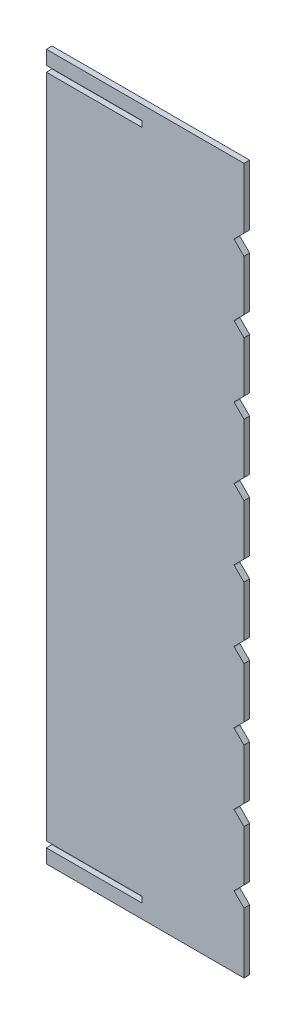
ISO-10303-21;
HEADER;
FILE_DESCRIPTION(('STEP AP214'),'2;1');
FILE_NAME('part.step','',(''),(''),'','','');
FILE_SCHEMA(('AUTOMOTIVE_DESIGN { 1 0 10303 214 1 1 1 1 }'));
ENDSEC;
DATA;
#1=APPLICATION_CONTEXT('core data for automotive mechanical design processes');
#2=APPLICATION_PROTOCOL_DEFINITION('international standard','automotive_design',2000,#1);
#3=PRODUCT_CONTEXT('',#1,'mechanical');
#4=PRODUCT('Part','Part','',(#3));
#5=PRODUCT_RELATED_PRODUCT_CATEGORY('part','',(#4));
#6=PRODUCT_DEFINITION_FORMATION('','',#4);
#7=PRODUCT_DEFINITION_CONTEXT('part definition',#1,'design');
#8=PRODUCT_DEFINITION('design','',#6,#7);
#9=PRODUCT_DEFINITION_SHAPE('','',#8);
#10=(LENGTH_UNIT() NAMED_UNIT(*) SI_UNIT(.MILLI.,.METRE.));
#11=(NAMED_UNIT(*) PLANE_ANGLE_UNIT() SI_UNIT($,.RADIAN.));
#12=(NAMED_UNIT(*) SI_UNIT($,.STERADIAN.) SOLID_ANGLE_UNIT());
#13=UNCERTAINTY_MEASURE_WITH_UNIT(LENGTH_MEASURE(1.E-05),#10,'distance_accuracy_value','');
#14=(GEOMETRIC_REPRESENTATION_CONTEXT(3) GLOBAL_UNCERTAINTY_ASSIGNED_CONTEXT((#13)) GLOBAL_UNIT_ASSIGNED_CONTEXT((#10,
#11,#12)) REPRESENTATION_CONTEXT('',''));
#15=CARTESIAN_POINT('',(0.,0.,0.));
#16=DIRECTION('',(0.,0.,1.));
#17=DIRECTION('',(1.,0.,0.));
#18=AXIS2_PLACEMENT_3D('',#15,#16,#17);
#19=CARTESIAN_POINT('',(-2509.2838,-552.0653,4.));
#20=DIRECTION('',(-0.707101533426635,-0.707112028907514,0.));
#21=DIRECTION('',(0.707112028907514,-0.707101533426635,0.));
#22=AXIS2_PLACEMENT_3D('',#19,#20,#21);
#23=PLANE('',#22);
#24=DIRECTION('',(-0.707112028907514,0.707101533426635,0.));
#25=VECTOR('',#24,1.);
#26=CARTESIAN_POINT('',(-2509.2838,-552.0653,0.));
#27=LINE('',#26,#25);
#28=CARTESIAN_POINT('',(-2502.5465,-558.8025,0.));
#29=VERTEX_POINT('',#28);
#30=CARTESIAN_POINT('',(-2509.2838,-552.0653,0.));
#31=VERTEX_POINT('',#30);
#32=EDGE_CURVE('E459',#29,#31,#27,.T.);
#33=ORIENTED_EDGE('',*,*,#32,.T.);
#34=DIRECTION('',(0.,0.,-1.));
#35=VECTOR('',#34,1.);
#36=CARTESIAN_POINT('',(-2509.2838,-552.0653,4.));
#37=LINE('',#36,#35);
#38=CARTESIAN_POINT('',(-2509.2838,-552.0653,4.));
#39=VERTEX_POINT('',#38);
#40=EDGE_CURVE('E11',#39,#31,#37,.T.);
#41=ORIENTED_EDGE('',*,*,#40,.F.);
#42=DIRECTION('',(-0.707112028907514,0.707101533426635,0.));
#43=VECTOR('',#42,1.);
#44=CARTESIAN_POINT('',(-2509.2838,-552.0653,4.));
#45=LINE('',#44,#43);
#46=CARTESIAN_POINT('',(-2502.5465,-558.8025,4.));
#47=VERTEX_POINT('',#46);
#48=EDGE_CURVE('E583',#47,#39,#45,.T.);
#49=ORIENTED_EDGE('',*,*,#48,.F.);
#50=DIRECTION('',(0.,0.,-1.));
#51=VECTOR('',#50,1.);
#52=CARTESIAN_POINT('',(-2502.5465,-558.8025,4.));
#53=LINE('',#52,#51);
#54=EDGE_CURVE('E455',#47,#29,#53,.T.);
#55=ORIENTED_EDGE('',*,*,#54,.T.);
#56=EDGE_LOOP('',(#33,#41,#49,#55));
#57=FACE_BOUND('',#56,.T.);
#58=ADVANCED_FACE('F39',(#57),#23,.F.);
#59=CARTESIAN_POINT('',(-2509.6178,-551.7314,4.));
#60=DIRECTION('',(-0.707000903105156,-0.70721264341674,0.));
#61=DIRECTION('',(0.70721264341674,-0.707000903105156,0.));
#62=AXIS2_PLACEMENT_3D('',#59,#60,#61);
#63=PLANE('',#62);
#64=DIRECTION('',(-0.70721264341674,0.707000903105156,0.));
#65=VECTOR('',#64,1.);
#66=CARTESIAN_POINT('',(-2509.6178,-551.7314,0.));
#67=LINE('',#66,#65);
#68=CARTESIAN_POINT('',(-2509.6178,-551.7314,0.));
#69=VERTEX_POINT('',#68);
#70=EDGE_CURVE('E462',#31,#69,#67,.T.);
#71=ORIENTED_EDGE('',*,*,#70,.T.);
#72=DIRECTION('',(0.,0.,-1.));
#73=VECTOR('',#72,1.);
#74=CARTESIAN_POINT('',(-2509.6178,-551.7314,4.));
#75=LINE('',#74,#73);
#76=CARTESIAN_POINT('',(-2509.6178,-551.7314,4.));
#77=VERTEX_POINT('',#76);
#78=EDGE_CURVE('E47',#77,#69,#75,.T.);
#79=ORIENTED_EDGE('',*,*,#78,.F.);
#80=DIRECTION('',(-0.70721264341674,0.707000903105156,0.));
#81=VECTOR('',#80,1.);
#82=CARTESIAN_POINT('',(-2509.6178,-551.7314,4.));
#83=LINE('',#82,#81);
#84=EDGE_CURVE('E260',#39,#77,#83,.T.);
#85=ORIENTED_EDGE('',*,*,#84,.F.);
#86=ORIENTED_EDGE('',*,*,#40,.T.);
#87=EDGE_LOOP('',(#71,#79,#85,#86));
#88=FACE_BOUND('',#87,.T.);
#89=ADVANCED_FACE('F911',(#88),#63,.F.);
#90=CARTESIAN_POINT('',(-2503.2562,-545.3699,4.));
#91=DIRECTION('',(-0.70710122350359,0.707112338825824,0.));
#92=DIRECTION('',(-0.707112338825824,-0.70710122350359,0.));
#93=AXIS2_PLACEMENT_3D('',#90,#91,#92);
#94=PLANE('',#93);
#95=DIRECTION('',(0.707112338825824,0.70710122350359,0.));
#96=VECTOR('',#95,1.);
#97=CARTESIAN_POINT('',(-2503.2562,-545.3699,0.));
#98=LINE('',#97,#96);
#99=CARTESIAN_POINT('',(-2503.2562,-545.3699,0.));
#100=VERTEX_POINT('',#99);
#101=EDGE_CURVE('E464',#69,#100,#98,.T.);
#102=ORIENTED_EDGE('',*,*,#101,.T.);
#103=DIRECTION('',(0.,0.,-1.));
#104=VECTOR('',#103,1.);
#105=CARTESIAN_POINT('',(-2503.2562,-545.3699,4.));
#106=LINE('',#105,#104);
#107=CARTESIAN_POINT('',(-2503.2562,-545.3699,4.));
#108=VERTEX_POINT('',#107);
#109=EDGE_CURVE('E752',#108,#100,#106,.T.);
#110=ORIENTED_EDGE('',*,*,#109,.F.);
#111=DIRECTION('',(0.707112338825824,0.70710122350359,0.));
#112=VECTOR('',#111,1.);
#113=CARTESIAN_POINT('',(-2503.2562,-545.3699,4.));
#114=LINE('',#113,#112);
#115=EDGE_CURVE('E760',#77,#108,#114,.T.);
#116=ORIENTED_EDGE('',*,*,#115,.F.);
#117=ORIENTED_EDGE('',*,*,#78,.T.);
#118=EDGE_LOOP('',(#102,#110,#116,#117));
#119=FACE_BOUND('',#118,.T.);
#120=ADVANCED_FACE('F758',(#119),#94,.F.);
#121=CARTESIAN_POINT('',(-2502.8805,-544.9941,4.));
#122=DIRECTION('',(-0.707200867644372,0.707012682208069,0.));
#123=DIRECTION('',(-0.707012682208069,-0.707200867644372,0.));
#124=AXIS2_PLACEMENT_3D('',#121,#122,#123);
#125=PLANE('',#124);
#126=DIRECTION('',(0.707012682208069,0.707200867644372,0.));
#127=VECTOR('',#126,1.);
#128=CARTESIAN_POINT('',(-2502.8805,-544.9941,0.));
#129=LINE('',#128,#127);
#130=CARTESIAN_POINT('',(-2502.8805,-544.9941,0.));
#131=VERTEX_POINT('',#130);
#132=EDGE_CURVE('E466',#100,#131,#129,.T.);
#133=ORIENTED_EDGE('',*,*,#132,.T.);
#134=DIRECTION('',(0.,0.,-1.));
#135=VECTOR('',#134,1.);
#136=CARTESIAN_POINT('',(-2502.8805,-544.9941,4.));
#137=LINE('',#136,#135);
#138=CARTESIAN_POINT('',(-2502.8805,-544.9941,4.));
#139=VERTEX_POINT('',#138);
#140=EDGE_CURVE('E749',#139,#131,#137,.T.);
#141=ORIENTED_EDGE('',*,*,#140,.F.);
#142=DIRECTION('',(0.707012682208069,0.707200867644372,0.));
#143=VECTOR('',#142,1.);
#144=CARTESIAN_POINT('',(-2502.8805,-544.9941,4.));
#145=LINE('',#144,#143);
#146=EDGE_CURVE('E778',#108,#139,#145,.T.);
#147=ORIENTED_EDGE('',*,*,#146,.F.);
#148=ORIENTED_EDGE('',*,*,#109,.T.);
#149=EDGE_LOOP('',(#133,#141,#147,#148));
#150=FACE_BOUND('',#149,.T.);
#151=ADVANCED_FACE('F769',(#150),#125,.F.);
#152=CARTESIAN_POINT('',(-2502.5465,-544.6603,4.));
#153=DIRECTION('',(-0.706894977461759,0.707318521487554,0.));
#154=DIRECTION('',(-0.707318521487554,-0.706894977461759,0.));
#155=AXIS2_PLACEMENT_3D('',#152,#153,#154);
#156=PLANE('',#155);
#157=DIRECTION('',(0.707318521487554,0.706894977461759,0.));
#158=VECTOR('',#157,1.);
#159=CARTESIAN_POINT('',(-2502.5465,-544.6603,0.));
#160=LINE('',#159,#158);
#161=CARTESIAN_POINT('',(-2502.5465,-544.6603,0.));
#162=VERTEX_POINT('',#161);
#163=EDGE_CURVE('E468',#131,#162,#160,.T.);
#164=ORIENTED_EDGE('',*,*,#163,.T.);
#165=DIRECTION('',(0.,0.,-1.));
#166=VECTOR('',#165,1.);
#167=CARTESIAN_POINT('',(-2502.5465,-544.6603,4.));
#168=LINE('',#167,#166);
#169=CARTESIAN_POINT('',(-2502.5465,-544.6603,4.));
#170=VERTEX_POINT('',#169);
#171=EDGE_CURVE('E746',#170,#162,#168,.T.);
#172=ORIENTED_EDGE('',*,*,#171,.F.);
#173=DIRECTION('',(0.707318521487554,0.706894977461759,0.));
#174=VECTOR('',#173,1.);
#175=CARTESIAN_POINT('',(-2502.5465,-544.6603,4.));
#176=LINE('',#175,#174);
#177=EDGE_CURVE('E775',#139,#170,#176,.T.);
#178=ORIENTED_EDGE('',*,*,#177,.F.);
#179=ORIENTED_EDGE('',*,*,#140,.T.);
#180=EDGE_LOOP('',(#164,#172,#178,#179));
#181=FACE_BOUND('',#180,.T.);
#182=ADVANCED_FACE('F773',(#181),#156,.F.);
#183=CARTESIAN_POINT('',(-2502.5465,-508.8025,4.));
#184=DIRECTION('',(-1.,0.,0.));
#185=DIRECTION('',(0.,0.,1.));
#186=AXIS2_PLACEMENT_3D('',#183,#184,#185);
#187=PLANE('',#186);
#188=DIRECTION('',(0.,1.,0.));
#189=VECTOR('',#188,1.);
#190=CARTESIAN_POINT('',(-2502.5465,-508.8025,0.));
#191=LINE('',#190,#189);
#192=CARTESIAN_POINT('',(-2502.5465,-508.8025,0.));
#193=VERTEX_POINT('',#192);
#194=EDGE_CURVE('E470',#162,#193,#191,.T.);
#195=ORIENTED_EDGE('',*,*,#194,.T.);
#196=DIRECTION('',(0.,0.,-1.));
#197=VECTOR('',#196,1.);
#198=CARTESIAN_POINT('',(-2502.5465,-508.8025,4.));
#199=LINE('',#198,#197);
#200=CARTESIAN_POINT('',(-2502.5465,-508.8025,4.));
#201=VERTEX_POINT('',#200);
#202=EDGE_CURVE('E743',#201,#193,#199,.T.);
#203=ORIENTED_EDGE('',*,*,#202,.F.);
#204=DIRECTION('',(0.,1.,0.));
#205=VECTOR('',#204,1.);
#206=CARTESIAN_POINT('',(-2502.5465,-508.8025,4.));
#207=LINE('',#206,#205);
#208=EDGE_CURVE('E777',#170,#201,#207,.T.);
#209=ORIENTED_EDGE('',*,*,#208,.F.);
#210=ORIENTED_EDGE('',*,*,#171,.T.);
#211=EDGE_LOOP('',(#195,#203,#209,#210));
#212=FACE_BOUND('',#211,.T.);
#213=ADVANCED_FACE('F924',(#212),#187,.F.);
#214=CARTESIAN_POINT('',(-2509.2838,-502.0654,4.));
#215=DIRECTION('',(-0.70709628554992,-0.70711727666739,0.));
#216=DIRECTION('',(0.70711727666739,-0.70709628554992,0.));
#217=AXIS2_PLACEMENT_3D('',#214,#215,#216);
#218=PLANE('',#217);
#219=DIRECTION('',(-0.70711727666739,0.70709628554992,0.));
#220=VECTOR('',#219,1.);
#221=CARTESIAN_POINT('',(-2509.2838,-502.0654,0.));
#222=LINE('',#221,#220);
#223=CARTESIAN_POINT('',(-2509.2838,-502.0654,0.));
#224=VERTEX_POINT('',#223);
#225=EDGE_CURVE('E472',#193,#224,#222,.T.);
#226=ORIENTED_EDGE('',*,*,#225,.T.);
#227=DIRECTION('',(0.,0.,-1.));
#228=VECTOR('',#227,1.);
#229=CARTESIAN_POINT('',(-2509.2838,-502.0654,4.));
#230=LINE('',#229,#228);
#231=CARTESIAN_POINT('',(-2509.2838,-502.0654,4.));
#232=VERTEX_POINT('',#231);
#233=EDGE_CURVE('E740',#232,#224,#230,.T.);
#234=ORIENTED_EDGE('',*,*,#233,.F.);
#235=DIRECTION('',(-0.70711727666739,0.70709628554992,0.));
#236=VECTOR('',#235,1.);
#237=CARTESIAN_POINT('',(-2509.2838,-502.0654,4.));
#238=LINE('',#237,#236);
#239=EDGE_CURVE('E780',#201,#232,#238,.T.);
#240=ORIENTED_EDGE('',*,*,#239,.F.);
#241=ORIENTED_EDGE('',*,*,#202,.T.);
#242=EDGE_LOOP('',(#226,#234,#240,#241));
#243=FACE_BOUND('',#242,.T.);
#244=ADVANCED_FACE('F927',(#243),#218,.F.);
#245=CARTESIAN_POINT('',(-2509.6178,-501.7314,4.));
#246=DIRECTION('',(-0.7071067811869,-0.707106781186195,0.));
#247=DIRECTION('',(0.707106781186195,-0.7071067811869,0.));
#248=AXIS2_PLACEMENT_3D('',#245,#246,#247);
#249=PLANE('',#248);
#250=DIRECTION('',(-0.707106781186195,0.7071067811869,0.));
#251=VECTOR('',#250,1.);
#252=CARTESIAN_POINT('',(-2509.6178,-501.7314,0.));
#253=LINE('',#252,#251);
#254=CARTESIAN_POINT('',(-2509.6178,-501.7314,0.));
#255=VERTEX_POINT('',#254);
#256=EDGE_CURVE('E474',#224,#255,#253,.T.);
#257=ORIENTED_EDGE('',*,*,#256,.T.);
#258=DIRECTION('',(0.,0.,-1.));
#259=VECTOR('',#258,1.);
#260=CARTESIAN_POINT('',(-2509.6178,-501.7314,4.));
#261=LINE('',#260,#259);
#262=CARTESIAN_POINT('',(-2509.6178,-501.7314,4.));
#263=VERTEX_POINT('',#262);
#264=EDGE_CURVE('E737',#263,#255,#261,.T.);
#265=ORIENTED_EDGE('',*,*,#264,.F.);
#266=DIRECTION('',(-0.707106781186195,0.7071067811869,0.));
#267=VECTOR('',#266,1.);
#268=CARTESIAN_POINT('',(-2509.6178,-501.7314,4.));
#269=LINE('',#268,#267);
#270=EDGE_CURVE('E786',#232,#263,#269,.T.);
#271=ORIENTED_EDGE('',*,*,#270,.F.);
#272=ORIENTED_EDGE('',*,*,#233,.T.);
#273=EDGE_LOOP('',(#257,#265,#271,#272));
#274=FACE_BOUND('',#273,.T.);
#275=ADVANCED_FACE('F931',(#274),#249,.F.);
#276=CARTESIAN_POINT('',(-2502.8805,-494.9943,4.));
#277=DIRECTION('',(-0.707096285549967,0.707117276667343,0.));
#278=DIRECTION('',(-0.707117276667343,-0.707096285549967,0.));
#279=AXIS2_PLACEMENT_3D('',#276,#277,#278);
#280=PLANE('',#279);
#281=DIRECTION('',(0.707117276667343,0.707096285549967,0.));
#282=VECTOR('',#281,1.);
#283=CARTESIAN_POINT('',(-2502.8805,-494.9943,0.));
#284=LINE('',#283,#282);
#285=CARTESIAN_POINT('',(-2502.8805,-494.9943,0.));
#286=VERTEX_POINT('',#285);
#287=EDGE_CURVE('E476',#255,#286,#284,.T.);
#288=ORIENTED_EDGE('',*,*,#287,.T.);
#289=DIRECTION('',(0.,0.,-1.));
#290=VECTOR('',#289,1.);
#291=CARTESIAN_POINT('',(-2502.8805,-494.9943,4.));
#292=LINE('',#291,#290);
#293=CARTESIAN_POINT('',(-2502.8805,-494.9943,4.));
#294=VERTEX_POINT('',#293);
#295=EDGE_CURVE('E734',#294,#286,#292,.T.);
#296=ORIENTED_EDGE('',*,*,#295,.F.);
#297=DIRECTION('',(0.707117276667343,0.707096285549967,0.));
#298=VECTOR('',#297,1.);
#299=CARTESIAN_POINT('',(-2502.8805,-494.9943,4.));
#300=LINE('',#299,#298);
#301=EDGE_CURVE('E788',#263,#294,#300,.T.);
#302=ORIENTED_EDGE('',*,*,#301,.F.);
#303=ORIENTED_EDGE('',*,*,#264,.T.);
#304=EDGE_LOOP('',(#288,#296,#302,#303));
#305=FACE_BOUND('',#304,.T.);
#306=ADVANCED_FACE('F935',(#305),#280,.F.);
#307=CARTESIAN_POINT('',(-2502.5465,-494.6604,4.));
#308=DIRECTION('',(-0.707000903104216,0.70721264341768,0.));
#309=DIRECTION('',(-0.70721264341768,-0.707000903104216,0.));
#310=AXIS2_PLACEMENT_3D('',#307,#308,#309);
#311=PLANE('',#310);
#312=DIRECTION('',(0.70721264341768,0.707000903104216,0.));
#313=VECTOR('',#312,1.);
#314=CARTESIAN_POINT('',(-2502.5465,-494.6604,0.));
#315=LINE('',#314,#313);
#316=CARTESIAN_POINT('',(-2502.5465,-494.6604,0.));
#317=VERTEX_POINT('',#316);
#318=EDGE_CURVE('E478',#286,#317,#315,.T.);
#319=ORIENTED_EDGE('',*,*,#318,.T.);
#320=DIRECTION('',(0.,0.,-1.));
#321=VECTOR('',#320,1.);
#322=CARTESIAN_POINT('',(-2502.5465,-494.6604,4.));
#323=LINE('',#322,#321);
#324=CARTESIAN_POINT('',(-2502.5465,-494.6604,4.));
#325=VERTEX_POINT('',#324);
#326=EDGE_CURVE('E731',#325,#317,#323,.T.);
#327=ORIENTED_EDGE('',*,*,#326,.F.);
#328=DIRECTION('',(0.70721264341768,0.707000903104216,0.));
#329=VECTOR('',#328,1.);
#330=CARTESIAN_POINT('',(-2502.5465,-494.6604,4.));
#331=LINE('',#330,#329);
#332=EDGE_CURVE('E790',#294,#325,#331,.T.);
#333=ORIENTED_EDGE('',*,*,#332,.F.);
#334=ORIENTED_EDGE('',*,*,#295,.T.);
#335=EDGE_LOOP('',(#319,#327,#333,#334));
#336=FACE_BOUND('',#335,.T.);
#337=ADVANCED_FACE('F939',(#336),#311,.F.);
#338=CARTESIAN_POINT('',(-2502.5465,-458.8025,4.));
#339=DIRECTION('',(-1.,0.,0.));
#340=DIRECTION('',(0.,0.,1.));
#341=AXIS2_PLACEMENT_3D('',#338,#339,#340);
#342=PLANE('',#341);
#343=DIRECTION('',(0.,1.,0.));
#344=VECTOR('',#343,1.);
#345=CARTESIAN_POINT('',(-2502.5465,-458.8025,0.));
#346=LINE('',#345,#344);
#347=CARTESIAN_POINT('',(-2502.5465,-458.8025,0.));
#348=VERTEX_POINT('',#347);
#349=EDGE_CURVE('E480',#317,#348,#346,.T.);
#350=ORIENTED_EDGE('',*,*,#349,.T.);
#351=DIRECTION('',(0.,0.,-1.));
#352=VECTOR('',#351,1.);
#353=CARTESIAN_POINT('',(-2502.5465,-458.8025,4.));
#354=LINE('',#353,#352);
#355=CARTESIAN_POINT('',(-2502.5465,-458.8025,4.));
#356=VERTEX_POINT('',#355);
#357=EDGE_CURVE('E728',#356,#348,#354,.T.);
#358=ORIENTED_EDGE('',*,*,#357,.F.);
#359=DIRECTION('',(0.,1.,0.));
#360=VECTOR('',#359,1.);
#361=CARTESIAN_POINT('',(-2502.5465,-458.8025,4.));
#362=LINE('',#361,#360);
#363=EDGE_CURVE('E792',#325,#356,#362,.T.);
#364=ORIENTED_EDGE('',*,*,#363,.F.);
#365=ORIENTED_EDGE('',*,*,#326,.T.);
#366=EDGE_LOOP('',(#350,#358,#364,#365));
#367=FACE_BOUND('',#366,.T.);
#368=ADVANCED_FACE('F943',(#367),#342,.F.);
#369=CARTESIAN_POINT('',(-2509.2838,-452.0654,4.));
#370=DIRECTION('',(-0.707096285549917,-0.707117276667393,0.));
#371=DIRECTION('',(0.707117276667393,-0.707096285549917,0.));
#372=AXIS2_PLACEMENT_3D('',#369,#370,#371);
#373=PLANE('',#372);
#374=DIRECTION('',(-0.707117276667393,0.707096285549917,0.));
#375=VECTOR('',#374,1.);
#376=CARTESIAN_POINT('',(-2509.2838,-452.0654,0.));
#377=LINE('',#376,#375);
#378=CARTESIAN_POINT('',(-2509.2838,-452.0654,0.));
#379=VERTEX_POINT('',#378);
#380=EDGE_CURVE('E482',#348,#379,#377,.T.);
#381=ORIENTED_EDGE('',*,*,#380,.T.);
#382=DIRECTION('',(0.,0.,-1.));
#383=VECTOR('',#382,1.);
#384=CARTESIAN_POINT('',(-2509.2838,-452.0654,4.));
#385=LINE('',#384,#383);
#386=CARTESIAN_POINT('',(-2509.2838,-452.0654,4.));
#387=VERTEX_POINT('',#386);
#388=EDGE_CURVE('E725',#387,#379,#385,.T.);
#389=ORIENTED_EDGE('',*,*,#388,.F.);
#390=DIRECTION('',(-0.707117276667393,0.707096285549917,0.));
#391=VECTOR('',#390,1.);
#392=CARTESIAN_POINT('',(-2509.2838,-452.0654,4.));
#393=LINE('',#392,#391);
#394=EDGE_CURVE('E794',#356,#387,#393,.T.);
#395=ORIENTED_EDGE('',*,*,#394,.F.);
#396=ORIENTED_EDGE('',*,*,#357,.T.);
#397=EDGE_LOOP('',(#381,#389,#395,#396));
#398=FACE_BOUND('',#397,.T.);
#399=ADVANCED_FACE('F947',(#398),#373,.F.);
#400=CARTESIAN_POINT('',(-2509.6178,-451.7314,4.));
#401=DIRECTION('',(-0.707106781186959,-0.707106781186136,0.));
#402=DIRECTION('',(0.707106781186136,-0.707106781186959,0.));
#403=AXIS2_PLACEMENT_3D('',#400,#401,#402);
#404=PLANE('',#403);
#405=DIRECTION('',(-0.707106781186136,0.707106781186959,0.));
#406=VECTOR('',#405,1.);
#407=CARTESIAN_POINT('',(-2509.6178,-451.7314,0.));
#408=LINE('',#407,#406);
#409=CARTESIAN_POINT('',(-2509.6178,-451.7314,0.));
#410=VERTEX_POINT('',#409);
#411=EDGE_CURVE('E484',#379,#410,#408,.T.);
#412=ORIENTED_EDGE('',*,*,#411,.T.);
#413=DIRECTION('',(0.,0.,-1.));
#414=VECTOR('',#413,1.);
#415=CARTESIAN_POINT('',(-2509.6178,-451.7314,4.));
#416=LINE('',#415,#414);
#417=CARTESIAN_POINT('',(-2509.6178,-451.7314,4.));
#418=VERTEX_POINT('',#417);
#419=EDGE_CURVE('E722',#418,#410,#416,.T.);
#420=ORIENTED_EDGE('',*,*,#419,.F.);
#421=DIRECTION('',(-0.707106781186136,0.707106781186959,0.));
#422=VECTOR('',#421,1.);
#423=CARTESIAN_POINT('',(-2509.6178,-451.7314,4.));
#424=LINE('',#423,#422);
#425=EDGE_CURVE('E796',#387,#418,#424,.T.);
#426=ORIENTED_EDGE('',*,*,#425,.F.);
#427=ORIENTED_EDGE('',*,*,#388,.T.);
#428=EDGE_LOOP('',(#412,#420,#426,#427));
#429=FACE_BOUND('',#428,.T.);
#430=ADVANCED_FACE('F951',(#429),#404,.F.);
#431=CARTESIAN_POINT('',(-2502.8805,-444.9943,4.));
#432=DIRECTION('',(-0.707096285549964,0.707117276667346,0.));
#433=DIRECTION('',(-0.707117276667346,-0.707096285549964,0.));
#434=AXIS2_PLACEMENT_3D('',#431,#432,#433);
#435=PLANE('',#434);
#436=DIRECTION('',(0.707117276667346,0.707096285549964,0.));
#437=VECTOR('',#436,1.);
#438=CARTESIAN_POINT('',(-2502.8805,-444.9943,0.));
#439=LINE('',#438,#437);
#440=CARTESIAN_POINT('',(-2502.8805,-444.9943,0.));
#441=VERTEX_POINT('',#440);
#442=EDGE_CURVE('E486',#410,#441,#439,.T.);
#443=ORIENTED_EDGE('',*,*,#442,.T.);
#444=DIRECTION('',(0.,0.,-1.));
#445=VECTOR('',#444,1.);
#446=CARTESIAN_POINT('',(-2502.8805,-444.9943,4.));
#447=LINE('',#446,#445);
#448=CARTESIAN_POINT('',(-2502.8805,-444.9943,4.));
#449=VERTEX_POINT('',#448);
#450=EDGE_CURVE('E719',#449,#441,#447,.T.);
#451=ORIENTED_EDGE('',*,*,#450,.F.);
#452=DIRECTION('',(0.707117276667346,0.707096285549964,0.));
#453=VECTOR('',#452,1.);
#454=CARTESIAN_POINT('',(-2502.8805,-444.9943,4.));
#455=LINE('',#454,#453);
#456=EDGE_CURVE('E798',#418,#449,#455,.T.);
#457=ORIENTED_EDGE('',*,*,#456,.F.);
#458=ORIENTED_EDGE('',*,*,#419,.T.);
#459=EDGE_LOOP('',(#443,#451,#457,#458));
#460=FACE_BOUND('',#459,.T.);
#461=ADVANCED_FACE('F955',(#460),#435,.F.);
#462=CARTESIAN_POINT('',(-2502.5465,-444.6604,4.));
#463=DIRECTION('',(-0.707000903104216,0.70721264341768,0.));
#464=DIRECTION('',(-0.70721264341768,-0.707000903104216,0.));
#465=AXIS2_PLACEMENT_3D('',#462,#463,#464);
#466=PLANE('',#465);
#467=DIRECTION('',(0.70721264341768,0.707000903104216,0.));
#468=VECTOR('',#467,1.);
#469=CARTESIAN_POINT('',(-2502.5465,-444.6604,0.));
#470=LINE('',#469,#468);
#471=CARTESIAN_POINT('',(-2502.5465,-444.6604,0.));
#472=VERTEX_POINT('',#471);
#473=EDGE_CURVE('E488',#441,#472,#470,.T.);
#474=ORIENTED_EDGE('',*,*,#473,.T.);
#475=DIRECTION('',(0.,0.,-1.));
#476=VECTOR('',#475,1.);
#477=CARTESIAN_POINT('',(-2502.5465,-444.6604,4.));
#478=LINE('',#477,#476);
#479=CARTESIAN_POINT('',(-2502.5465,-444.6604,4.));
#480=VERTEX_POINT('',#479);
#481=EDGE_CURVE('E716',#480,#472,#478,.T.);
#482=ORIENTED_EDGE('',*,*,#481,.F.);
#483=DIRECTION('',(0.70721264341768,0.707000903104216,0.));
#484=VECTOR('',#483,1.);
#485=CARTESIAN_POINT('',(-2502.5465,-444.6604,4.));
#486=LINE('',#485,#484);
#487=EDGE_CURVE('E800',#449,#480,#486,.T.);
#488=ORIENTED_EDGE('',*,*,#487,.F.);
#489=ORIENTED_EDGE('',*,*,#450,.T.);
#490=EDGE_LOOP('',(#474,#482,#488,#489));
#491=FACE_BOUND('',#490,.T.);
#492=ADVANCED_FACE('F959',(#491),#466,.F.);
#493=CARTESIAN_POINT('',(-2502.5465,-401.7314,4.));
#494=DIRECTION('',(-1.,0.,0.));
#495=DIRECTION('',(0.,0.,1.));
#496=AXIS2_PLACEMENT_3D('',#493,#494,#495);
#497=PLANE('',#496);
#498=DIRECTION('',(0.,1.,0.));
#499=VECTOR('',#498,1.);
#500=CARTESIAN_POINT('',(-2502.5465,-401.7314,0.));
#501=LINE('',#500,#499);
#502=CARTESIAN_POINT('',(-2502.5465,-401.7314,0.));
#503=VERTEX_POINT('',#502);
#504=EDGE_CURVE('E490',#472,#503,#501,.T.);
#505=ORIENTED_EDGE('',*,*,#504,.T.);
#506=DIRECTION('',(0.,0.,-1.));
#507=VECTOR('',#506,1.);
#508=CARTESIAN_POINT('',(-2502.5465,-401.7314,4.));
#509=LINE('',#508,#507);
#510=CARTESIAN_POINT('',(-2502.5465,-401.7314,4.));
#511=VERTEX_POINT('',#510);
#512=EDGE_CURVE('E713',#511,#503,#509,.T.);
#513=ORIENTED_EDGE('',*,*,#512,.F.);
#514=DIRECTION('',(0.,1.,0.));
#515=VECTOR('',#514,1.);
#516=CARTESIAN_POINT('',(-2502.5465,-401.7314,4.));
#517=LINE('',#516,#515);
#518=EDGE_CURVE('E802',#480,#511,#517,.T.);
#519=ORIENTED_EDGE('',*,*,#518,.F.);
#520=ORIENTED_EDGE('',*,*,#481,.T.);
#521=EDGE_LOOP('',(#505,#513,#519,#520));
#522=FACE_BOUND('',#521,.T.);
#523=ADVANCED_FACE('F963',(#522),#497,.F.);
#524=CARTESIAN_POINT('',(-2642.5468,-401.7314,4.));
#525=DIRECTION('',(0.,-1.,0.));
#526=DIRECTION('',(0.,0.,-1.));
#527=AXIS2_PLACEMENT_3D('',#524,#525,#526);
#528=PLANE('',#527);
#529=DIRECTION('',(-1.,0.,0.));
#530=VECTOR('',#529,1.);
#531=CARTESIAN_POINT('',(-2642.5468,-401.7314,0.));
#532=LINE('',#531,#530);
#533=CARTESIAN_POINT('',(-2642.5468,-401.7314,0.));
#534=VERTEX_POINT('',#533);
#535=EDGE_CURVE('E492',#503,#534,#532,.T.);
#536=ORIENTED_EDGE('',*,*,#535,.T.);
#537=DIRECTION('',(0.,0.,-1.));
#538=VECTOR('',#537,1.);
#539=CARTESIAN_POINT('',(-2642.5468,-401.7314,4.));
#540=LINE('',#539,#538);
#541=CARTESIAN_POINT('',(-2642.5468,-401.7314,4.));
#542=VERTEX_POINT('',#541);
#543=EDGE_CURVE('E710',#542,#534,#540,.T.);
#544=ORIENTED_EDGE('',*,*,#543,.F.);
#545=DIRECTION('',(-1.,0.,0.));
#546=VECTOR('',#545,1.);
#547=CARTESIAN_POINT('',(-2642.5468,-401.7314,4.));
#548=LINE('',#547,#546);
#549=EDGE_CURVE('E804',#511,#542,#548,.T.);
#550=ORIENTED_EDGE('',*,*,#549,.F.);
#551=ORIENTED_EDGE('',*,*,#512,.T.);
#552=EDGE_LOOP('',(#536,#544,#550,#551));
#553=FACE_BOUND('',#552,.T.);
#554=ADVANCED_FACE('F967',(#553),#528,.F.);
#555=CARTESIAN_POINT('',(-2642.5468,-411.6314,4.));
#556=DIRECTION('',(1.,0.,0.));
#557=DIRECTION('',(0.,0.,-1.));
#558=AXIS2_PLACEMENT_3D('',#555,#556,#557);
#559=PLANE('',#558);
#560=DIRECTION('',(0.,-1.,0.));
#561=VECTOR('',#560,1.);
#562=CARTESIAN_POINT('',(-2642.5468,-411.6314,0.));
#563=LINE('',#562,#561);
#564=CARTESIAN_POINT('',(-2642.5468,-411.6314,0.));
#565=VERTEX_POINT('',#564);
#566=EDGE_CURVE('E494',#534,#565,#563,.T.);
#567=ORIENTED_EDGE('',*,*,#566,.T.);
#568=DIRECTION('',(0.,0.,-1.));
#569=VECTOR('',#568,1.);
#570=CARTESIAN_POINT('',(-2642.5468,-411.6314,4.));
#571=LINE('',#570,#569);
#572=CARTESIAN_POINT('',(-2642.5468,-411.6314,4.));
#573=VERTEX_POINT('',#572);
#574=EDGE_CURVE('E707',#573,#565,#571,.T.);
#575=ORIENTED_EDGE('',*,*,#574,.F.);
#576=DIRECTION('',(0.,-1.,0.));
#577=VECTOR('',#576,1.);
#578=CARTESIAN_POINT('',(-2642.5468,-411.6314,4.));
#579=LINE('',#578,#577);
#580=EDGE_CURVE('E806',#542,#573,#579,.T.);
#581=ORIENTED_EDGE('',*,*,#580,.F.);
#582=ORIENTED_EDGE('',*,*,#543,.T.);
#583=EDGE_LOOP('',(#567,#575,#581,#582));
#584=FACE_BOUND('',#583,.T.);
#585=ADVANCED_FACE('F971',(#584),#559,.F.);
#586=CARTESIAN_POINT('',(-2574.8949,-411.6314,4.));
#587=DIRECTION('',(0.,1.,0.));
#588=DIRECTION('',(0.,0.,1.));
#589=AXIS2_PLACEMENT_3D('',#586,#587,#588);
#590=PLANE('',#589);
#591=DIRECTION('',(1.,0.,0.));
#592=VECTOR('',#591,1.);
#593=CARTESIAN_POINT('',(-2574.8949,-411.6314,0.));
#594=LINE('',#593,#592);
#595=CARTESIAN_POINT('',(-2574.8949,-411.6314,0.));
#596=VERTEX_POINT('',#595);
#597=EDGE_CURVE('E496',#565,#596,#594,.T.);
#598=ORIENTED_EDGE('',*,*,#597,.T.);
#599=DIRECTION('',(0.,0.,-1.));
#600=VECTOR('',#599,1.);
#601=CARTESIAN_POINT('',(-2574.8949,-411.6314,4.));
#602=LINE('',#601,#600);
#603=CARTESIAN_POINT('',(-2574.8949,-411.6314,4.));
#604=VERTEX_POINT('',#603);
#605=EDGE_CURVE('E704',#604,#596,#602,.T.);
#606=ORIENTED_EDGE('',*,*,#605,.F.);
#607=DIRECTION('',(1.,0.,0.));
#608=VECTOR('',#607,1.);
#609=CARTESIAN_POINT('',(-2574.8949,-411.6314,4.));
#610=LINE('',#609,#608);
#611=EDGE_CURVE('E808',#573,#604,#610,.T.);
#612=ORIENTED_EDGE('',*,*,#611,.F.);
#613=ORIENTED_EDGE('',*,*,#574,.T.);
#614=EDGE_LOOP('',(#598,#606,#612,#613));
#615=FACE_BOUND('',#614,.T.);
#616=ADVANCED_FACE('F975',(#615),#590,.F.);
#617=CARTESIAN_POINT('',(-2574.8949,-415.8314,4.));
#618=DIRECTION('',(1.,0.,0.));
#619=DIRECTION('',(0.,0.,-1.));
#620=AXIS2_PLACEMENT_3D('',#617,#618,#619);
#621=PLANE('',#620);
#622=DIRECTION('',(0.,-1.,0.));
#623=VECTOR('',#622,1.);
#624=CARTESIAN_POINT('',(-2574.8949,-415.8314,0.));
#625=LINE('',#624,#623);
#626=CARTESIAN_POINT('',(-2574.8949,-415.8314,0.));
#627=VERTEX_POINT('',#626);
#628=EDGE_CURVE('E499',#596,#627,#625,.T.);
#629=ORIENTED_EDGE('',*,*,#628,.T.);
#630=DIRECTION('',(0.,0.,-1.));
#631=VECTOR('',#630,1.);
#632=CARTESIAN_POINT('',(-2574.8949,-415.8314,4.));
#633=LINE('',#632,#631);
#634=CARTESIAN_POINT('',(-2574.8949,-415.8314,4.));
#635=VERTEX_POINT('',#634);
#636=EDGE_CURVE('E701',#635,#627,#633,.T.);
#637=ORIENTED_EDGE('',*,*,#636,.F.);
#638=DIRECTION('',(0.,-1.,0.));
#639=VECTOR('',#638,1.);
#640=CARTESIAN_POINT('',(-2574.8949,-411.7314,4.));
#641=LINE('',#640,#639);
#642=EDGE_CURVE('E810',#604,#635,#641,.T.);
#643=ORIENTED_EDGE('',*,*,#642,.F.);
#644=ORIENTED_EDGE('',*,*,#605,.T.);
#645=EDGE_LOOP('',(#629,#637,#643,#644));
#646=FACE_BOUND('',#645,.T.);
#647=ADVANCED_FACE('F979',(#646),#621,.F.);
#648=CARTESIAN_POINT('',(-2642.5468,-415.8314,4.));
#649=DIRECTION('',(0.,-1.,0.));
#650=DIRECTION('',(0.,0.,-1.));
#651=AXIS2_PLACEMENT_3D('',#648,#649,#650);
#652=PLANE('',#651);
#653=DIRECTION('',(-1.,0.,0.));
#654=VECTOR('',#653,1.);
#655=CARTESIAN_POINT('',(-2642.5468,-415.8314,0.));
#656=LINE('',#655,#654);
#657=CARTESIAN_POINT('',(-2642.5468,-415.8314,0.));
#658=VERTEX_POINT('',#657);
#659=EDGE_CURVE('E501',#627,#658,#656,.T.);
#660=ORIENTED_EDGE('',*,*,#659,.T.);
#661=DIRECTION('',(0.,0.,-1.));
#662=VECTOR('',#661,1.);
#663=CARTESIAN_POINT('',(-2642.5468,-415.8314,4.));
#664=LINE('',#663,#662);
#665=CARTESIAN_POINT('',(-2642.5468,-415.8314,4.));
#666=VERTEX_POINT('',#665);
#667=EDGE_CURVE('E698',#666,#658,#664,.T.);
#668=ORIENTED_EDGE('',*,*,#667,.F.);
#669=DIRECTION('',(-1.,0.,0.));
#670=VECTOR('',#669,1.);
#671=CARTESIAN_POINT('',(-2642.5468,-415.8314,4.));
#672=LINE('',#671,#670);
#673=EDGE_CURVE('E812',#635,#666,#672,.T.);
#674=ORIENTED_EDGE('',*,*,#673,.F.);
#675=ORIENTED_EDGE('',*,*,#636,.T.);
#676=EDGE_LOOP('',(#660,#668,#674,#675));
#677=FACE_BOUND('',#676,.T.);
#678=ADVANCED_FACE('F983',(#677),#652,.F.);
#679=CARTESIAN_POINT('',(-2642.5468,-887.6314,4.));
#680=DIRECTION('',(1.,0.,0.));
#681=DIRECTION('',(0.,0.,-1.));
#682=AXIS2_PLACEMENT_3D('',#679,#680,#681);
#683=PLANE('',#682);
#684=DIRECTION('',(0.,-1.,0.));
#685=VECTOR('',#684,1.);
#686=CARTESIAN_POINT('',(-2642.5468,-887.6314,0.));
#687=LINE('',#686,#685);
#688=CARTESIAN_POINT('',(-2642.5468,-887.6314,0.));
#689=VERTEX_POINT('',#688);
#690=EDGE_CURVE('E503',#658,#689,#687,.T.);
#691=ORIENTED_EDGE('',*,*,#690,.T.);
#692=DIRECTION('',(0.,0.,-1.));
#693=VECTOR('',#692,1.);
#694=CARTESIAN_POINT('',(-2642.5468,-887.6314,4.));
#695=LINE('',#694,#693);
#696=CARTESIAN_POINT('',(-2642.5468,-887.6314,4.));
#697=VERTEX_POINT('',#696);
#698=EDGE_CURVE('E695',#697,#689,#695,.T.);
#699=ORIENTED_EDGE('',*,*,#698,.F.);
#700=DIRECTION('',(0.,-1.,0.));
#701=VECTOR('',#700,1.);
#702=CARTESIAN_POINT('',(-2642.5468,-887.6314,4.));
#703=LINE('',#702,#701);
#704=EDGE_CURVE('E814',#666,#697,#703,.T.);
#705=ORIENTED_EDGE('',*,*,#704,.F.);
#706=ORIENTED_EDGE('',*,*,#667,.T.);
#707=EDGE_LOOP('',(#691,#699,#705,#706));
#708=FACE_BOUND('',#707,.T.);
#709=ADVANCED_FACE('F987',(#708),#683,.F.);
#710=CARTESIAN_POINT('',(-2574.8947,-887.6314,4.));
#711=DIRECTION('',(0.,1.,0.));
#712=DIRECTION('',(0.,0.,1.));
#713=AXIS2_PLACEMENT_3D('',#710,#711,#712);
#714=PLANE('',#713);
#715=DIRECTION('',(1.,0.,0.));
#716=VECTOR('',#715,1.);
#717=CARTESIAN_POINT('',(-2574.8947,-887.6314,0.));
#718=LINE('',#717,#716);
#719=CARTESIAN_POINT('',(-2574.8947,-887.6314,0.));
#720=VERTEX_POINT('',#719);
#721=EDGE_CURVE('E505',#689,#720,#718,.T.);
#722=ORIENTED_EDGE('',*,*,#721,.T.);
#723=DIRECTION('',(0.,0.,-1.));
#724=VECTOR('',#723,1.);
#725=CARTESIAN_POINT('',(-2574.8947,-887.6314,4.));
#726=LINE('',#725,#724);
#727=CARTESIAN_POINT('',(-2574.8947,-887.6314,4.));
#728=VERTEX_POINT('',#727);
#729=EDGE_CURVE('E692',#728,#720,#726,.T.);
#730=ORIENTED_EDGE('',*,*,#729,.F.);
#731=DIRECTION('',(1.,0.,0.));
#732=VECTOR('',#731,1.);
#733=CARTESIAN_POINT('',(-2574.8947,-887.6314,4.));
#734=LINE('',#733,#732);
#735=EDGE_CURVE('E816',#697,#728,#734,.T.);
#736=ORIENTED_EDGE('',*,*,#735,.F.);
#737=ORIENTED_EDGE('',*,*,#698,.T.);
#738=EDGE_LOOP('',(#722,#730,#736,#737));
#739=FACE_BOUND('',#738,.T.);
#740=ADVANCED_FACE('F991',(#739),#714,.F.);
#741=CARTESIAN_POINT('',(-2574.8947,-891.8314,4.));
#742=DIRECTION('',(1.,0.,0.));
#743=DIRECTION('',(0.,0.,-1.));
#744=AXIS2_PLACEMENT_3D('',#741,#742,#743);
#745=PLANE('',#744);
#746=DIRECTION('',(0.,-1.,0.));
#747=VECTOR('',#746,1.);
#748=CARTESIAN_POINT('',(-2574.8947,-891.8314,0.));
#749=LINE('',#748,#747);
#750=CARTESIAN_POINT('',(-2574.8947,-891.8314,0.));
#751=VERTEX_POINT('',#750);
#752=EDGE_CURVE('E508',#720,#751,#749,.T.);
#753=ORIENTED_EDGE('',*,*,#752,.T.);
#754=DIRECTION('',(0.,0.,-1.));
#755=VECTOR('',#754,1.);
#756=CARTESIAN_POINT('',(-2574.8947,-891.8314,4.));
#757=LINE('',#756,#755);
#758=CARTESIAN_POINT('',(-2574.8947,-891.8314,4.));
#759=VERTEX_POINT('',#758);
#760=EDGE_CURVE('E689',#759,#751,#757,.T.);
#761=ORIENTED_EDGE('',*,*,#760,.F.);
#762=DIRECTION('',(0.,-1.,0.));
#763=VECTOR('',#762,1.);
#764=CARTESIAN_POINT('',(-2574.8947,-887.7314,4.));
#765=LINE('',#764,#763);
#766=EDGE_CURVE('E818',#728,#759,#765,.T.);
#767=ORIENTED_EDGE('',*,*,#766,.F.);
#768=ORIENTED_EDGE('',*,*,#729,.T.);
#769=EDGE_LOOP('',(#753,#761,#767,#768));
#770=FACE_BOUND('',#769,.T.);
#771=ADVANCED_FACE('F995',(#770),#745,.F.);
#772=CARTESIAN_POINT('',(-2642.5468,-891.8314,4.));
#773=DIRECTION('',(0.,-1.,0.));
#774=DIRECTION('',(0.,0.,-1.));
#775=AXIS2_PLACEMENT_3D('',#772,#773,#774);
#776=PLANE('',#775);
#777=DIRECTION('',(-1.,0.,0.));
#778=VECTOR('',#777,1.);
#779=CARTESIAN_POINT('',(-2642.5468,-891.8314,0.));
#780=LINE('',#779,#778);
#781=CARTESIAN_POINT('',(-2642.5468,-891.8314,0.));
#782=VERTEX_POINT('',#781);
#783=EDGE_CURVE('E510',#751,#782,#780,.T.);
#784=ORIENTED_EDGE('',*,*,#783,.T.);
#785=DIRECTION('',(0.,0.,-1.));
#786=VECTOR('',#785,1.);
#787=CARTESIAN_POINT('',(-2642.5468,-891.8314,4.));
#788=LINE('',#787,#786);
#789=CARTESIAN_POINT('',(-2642.5468,-891.8314,4.));
#790=VERTEX_POINT('',#789);
#791=EDGE_CURVE('E686',#790,#782,#788,.T.);
#792=ORIENTED_EDGE('',*,*,#791,.F.);
#793=DIRECTION('',(-1.,0.,0.));
#794=VECTOR('',#793,1.);
#795=CARTESIAN_POINT('',(-2642.5468,-891.8314,4.));
#796=LINE('',#795,#794);
#797=EDGE_CURVE('E820',#759,#790,#796,.T.);
#798=ORIENTED_EDGE('',*,*,#797,.F.);
#799=ORIENTED_EDGE('',*,*,#760,.T.);
#800=EDGE_LOOP('',(#784,#792,#798,#799));
#801=FACE_BOUND('',#800,.T.);
#802=ADVANCED_FACE('F999',(#801),#776,.F.);
#803=CARTESIAN_POINT('',(-2642.5468,-901.7314,4.));
#804=DIRECTION('',(1.,0.,0.));
#805=DIRECTION('',(0.,0.,-1.));
#806=AXIS2_PLACEMENT_3D('',#803,#804,#805);
#807=PLANE('',#806);
#808=DIRECTION('',(0.,-1.,0.));
#809=VECTOR('',#808,1.);
#810=CARTESIAN_POINT('',(-2642.5468,-901.7314,0.));
#811=LINE('',#810,#809);
#812=CARTESIAN_POINT('',(-2642.5468,-901.7314,0.));
#813=VERTEX_POINT('',#812);
#814=EDGE_CURVE('E512',#782,#813,#811,.T.);
#815=ORIENTED_EDGE('',*,*,#814,.T.);
#816=DIRECTION('',(0.,0.,-1.));
#817=VECTOR('',#816,1.);
#818=CARTESIAN_POINT('',(-2642.5468,-901.7314,4.));
#819=LINE('',#818,#817);
#820=CARTESIAN_POINT('',(-2642.5468,-901.7314,4.));
#821=VERTEX_POINT('',#820);
#822=EDGE_CURVE('E683',#821,#813,#819,.T.);
#823=ORIENTED_EDGE('',*,*,#822,.F.);
#824=DIRECTION('',(0.,-1.,0.));
#825=VECTOR('',#824,1.);
#826=CARTESIAN_POINT('',(-2642.5468,-901.7314,4.));
#827=LINE('',#826,#825);
#828=EDGE_CURVE('E822',#790,#821,#827,.T.);
#829=ORIENTED_EDGE('',*,*,#828,.F.);
#830=ORIENTED_EDGE('',*,*,#791,.T.);
#831=EDGE_LOOP('',(#815,#823,#829,#830));
#832=FACE_BOUND('',#831,.T.);
#833=ADVANCED_FACE('F1003',(#832),#807,.F.);
#834=CARTESIAN_POINT('',(-2502.5465,-901.7314,4.));
#835=DIRECTION('',(0.,1.,0.));
#836=DIRECTION('',(0.,0.,1.));
#837=AXIS2_PLACEMENT_3D('',#834,#835,#836);
#838=PLANE('',#837);
#839=DIRECTION('',(1.,0.,0.));
#840=VECTOR('',#839,1.);
#841=CARTESIAN_POINT('',(-2502.5465,-901.7314,0.));
#842=LINE('',#841,#840);
#843=CARTESIAN_POINT('',(-2502.5465,-901.7314,0.));
#844=VERTEX_POINT('',#843);
#845=EDGE_CURVE('E514',#813,#844,#842,.T.);
#846=ORIENTED_EDGE('',*,*,#845,.T.);
#847=DIRECTION('',(0.,0.,-1.));
#848=VECTOR('',#847,1.);
#849=CARTESIAN_POINT('',(-2502.5465,-901.7314,4.));
#850=LINE('',#849,#848);
#851=CARTESIAN_POINT('',(-2502.5465,-901.7314,4.));
#852=VERTEX_POINT('',#851);
#853=EDGE_CURVE('E680',#852,#844,#850,.T.);
#854=ORIENTED_EDGE('',*,*,#853,.F.);
#855=DIRECTION('',(1.,0.,0.));
#856=VECTOR('',#855,1.);
#857=CARTESIAN_POINT('',(-2502.5465,-901.7314,4.));
#858=LINE('',#857,#856);
#859=EDGE_CURVE('E824',#821,#852,#858,.T.);
#860=ORIENTED_EDGE('',*,*,#859,.F.);
#861=ORIENTED_EDGE('',*,*,#822,.T.);
#862=EDGE_LOOP('',(#846,#854,#860,#861));
#863=FACE_BOUND('',#862,.T.);
#864=ADVANCED_FACE('F1007',(#863),#838,.F.);
#865=CARTESIAN_POINT('',(-2502.5465,-858.8025,4.));
#866=DIRECTION('',(-1.,0.,0.));
#867=DIRECTION('',(0.,0.,1.));
#868=AXIS2_PLACEMENT_3D('',#865,#866,#867);
#869=PLANE('',#868);
#870=DIRECTION('',(0.,1.,0.));
#871=VECTOR('',#870,1.);
#872=CARTESIAN_POINT('',(-2502.5465,-858.8025,0.));
#873=LINE('',#872,#871);
#874=CARTESIAN_POINT('',(-2502.5465,-858.8025,0.));
#875=VERTEX_POINT('',#874);
#876=EDGE_CURVE('E516',#844,#875,#873,.T.);
#877=ORIENTED_EDGE('',*,*,#876,.T.);
#878=DIRECTION('',(0.,0.,-1.));
#879=VECTOR('',#878,1.);
#880=CARTESIAN_POINT('',(-2502.5465,-858.8025,4.));
#881=LINE('',#880,#879);
#882=CARTESIAN_POINT('',(-2502.5465,-858.8025,4.));
#883=VERTEX_POINT('',#882);
#884=EDGE_CURVE('E677',#883,#875,#881,.T.);
#885=ORIENTED_EDGE('',*,*,#884,.F.);
#886=DIRECTION('',(0.,1.,0.));
#887=VECTOR('',#886,1.);
#888=CARTESIAN_POINT('',(-2502.5465,-858.8025,4.));
#889=LINE('',#888,#887);
#890=EDGE_CURVE('E826',#852,#883,#889,.T.);
#891=ORIENTED_EDGE('',*,*,#890,.F.);
#892=ORIENTED_EDGE('',*,*,#853,.T.);
#893=EDGE_LOOP('',(#877,#885,#891,#892));
#894=FACE_BOUND('',#893,.T.);
#895=ADVANCED_FACE('F1011',(#894),#869,.F.);
#896=CARTESIAN_POINT('',(-2509.2838,-852.0654,4.));
#897=DIRECTION('',(-0.70709628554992,-0.70711727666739,0.));
#898=DIRECTION('',(0.70711727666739,-0.70709628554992,0.));
#899=AXIS2_PLACEMENT_3D('',#896,#897,#898);
#900=PLANE('',#899);
#901=DIRECTION('',(-0.70711727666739,0.70709628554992,0.));
#902=VECTOR('',#901,1.);
#903=CARTESIAN_POINT('',(-2509.2838,-852.0654,0.));
#904=LINE('',#903,#902);
#905=CARTESIAN_POINT('',(-2509.2838,-852.0654,0.));
#906=VERTEX_POINT('',#905);
#907=EDGE_CURVE('E518',#875,#906,#904,.T.);
#908=ORIENTED_EDGE('',*,*,#907,.T.);
#909=DIRECTION('',(0.,0.,-1.));
#910=VECTOR('',#909,1.);
#911=CARTESIAN_POINT('',(-2509.2838,-852.0654,4.));
#912=LINE('',#911,#910);
#913=CARTESIAN_POINT('',(-2509.2838,-852.0654,4.));
#914=VERTEX_POINT('',#913);
#915=EDGE_CURVE('E674',#914,#906,#912,.T.);
#916=ORIENTED_EDGE('',*,*,#915,.F.);
#917=DIRECTION('',(-0.70711727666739,0.70709628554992,0.));
#918=VECTOR('',#917,1.);
#919=CARTESIAN_POINT('',(-2509.2838,-852.0654,4.));
#920=LINE('',#919,#918);
#921=EDGE_CURVE('E828',#883,#914,#920,.T.);
#922=ORIENTED_EDGE('',*,*,#921,.F.);
#923=ORIENTED_EDGE('',*,*,#884,.T.);
#924=EDGE_LOOP('',(#908,#916,#922,#923));
#925=FACE_BOUND('',#924,.T.);
#926=ADVANCED_FACE('F1015',(#925),#900,.F.);
#927=CARTESIAN_POINT('',(-2509.6178,-851.7314,4.));
#928=DIRECTION('',(-0.7071067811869,-0.707106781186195,0.));
#929=DIRECTION('',(0.707106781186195,-0.7071067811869,0.));
#930=AXIS2_PLACEMENT_3D('',#927,#928,#929);
#931=PLANE('',#930);
#932=DIRECTION('',(-0.707106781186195,0.7071067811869,0.));
#933=VECTOR('',#932,1.);
#934=CARTESIAN_POINT('',(-2509.6178,-851.7314,0.));
#935=LINE('',#934,#933);
#936=CARTESIAN_POINT('',(-2509.6178,-851.7314,0.));
#937=VERTEX_POINT('',#936);
#938=EDGE_CURVE('E520',#906,#937,#935,.T.);
#939=ORIENTED_EDGE('',*,*,#938,.T.);
#940=DIRECTION('',(0.,0.,-1.));
#941=VECTOR('',#940,1.);
#942=CARTESIAN_POINT('',(-2509.6178,-851.7314,4.));
#943=LINE('',#942,#941);
#944=CARTESIAN_POINT('',(-2509.6178,-851.7314,4.));
#945=VERTEX_POINT('',#944);
#946=EDGE_CURVE('E671',#945,#937,#943,.T.);
#947=ORIENTED_EDGE('',*,*,#946,.F.);
#948=DIRECTION('',(-0.707106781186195,0.7071067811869,0.));
#949=VECTOR('',#948,1.);
#950=CARTESIAN_POINT('',(-2509.6178,-851.7314,4.));
#951=LINE('',#950,#949);
#952=EDGE_CURVE('E830',#914,#945,#951,.T.);
#953=ORIENTED_EDGE('',*,*,#952,.F.);
#954=ORIENTED_EDGE('',*,*,#915,.T.);
#955=EDGE_LOOP('',(#939,#947,#953,#954));
#956=FACE_BOUND('',#955,.T.);
#957=ADVANCED_FACE('F1019',(#956),#931,.F.);
#958=CARTESIAN_POINT('',(-2502.8805,-844.9943,4.));
#959=DIRECTION('',(-0.707096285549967,0.707117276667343,0.));
#960=DIRECTION('',(-0.707117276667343,-0.707096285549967,0.));
#961=AXIS2_PLACEMENT_3D('',#958,#959,#960);
#962=PLANE('',#961);
#963=DIRECTION('',(0.707117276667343,0.707096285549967,0.));
#964=VECTOR('',#963,1.);
#965=CARTESIAN_POINT('',(-2502.8805,-844.9943,0.));
#966=LINE('',#965,#964);
#967=CARTESIAN_POINT('',(-2502.8805,-844.9943,0.));
#968=VERTEX_POINT('',#967);
#969=EDGE_CURVE('E522',#937,#968,#966,.T.);
#970=ORIENTED_EDGE('',*,*,#969,.T.);
#971=DIRECTION('',(0.,0.,-1.));
#972=VECTOR('',#971,1.);
#973=CARTESIAN_POINT('',(-2502.8805,-844.9943,4.));
#974=LINE('',#973,#972);
#975=CARTESIAN_POINT('',(-2502.8805,-844.9943,4.));
#976=VERTEX_POINT('',#975);
#977=EDGE_CURVE('E668',#976,#968,#974,.T.);
#978=ORIENTED_EDGE('',*,*,#977,.F.);
#979=DIRECTION('',(0.707117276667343,0.707096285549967,0.));
#980=VECTOR('',#979,1.);
#981=CARTESIAN_POINT('',(-2502.8805,-844.9943,4.));
#982=LINE('',#981,#980);
#983=EDGE_CURVE('E832',#945,#976,#982,.T.);
#984=ORIENTED_EDGE('',*,*,#983,.F.);
#985=ORIENTED_EDGE('',*,*,#946,.T.);
#986=EDGE_LOOP('',(#970,#978,#984,#985));
#987=FACE_BOUND('',#986,.T.);
#988=ADVANCED_FACE('F1023',(#987),#962,.F.);
#989=CARTESIAN_POINT('',(-2502.5465,-844.6604,4.));
#990=DIRECTION('',(-0.707000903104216,0.70721264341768,0.));
#991=DIRECTION('',(-0.70721264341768,-0.707000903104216,0.));
#992=AXIS2_PLACEMENT_3D('',#989,#990,#991);
#993=PLANE('',#992);
#994=DIRECTION('',(0.70721264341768,0.707000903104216,0.));
#995=VECTOR('',#994,1.);
#996=CARTESIAN_POINT('',(-2502.5465,-844.6604,0.));
#997=LINE('',#996,#995);
#998=CARTESIAN_POINT('',(-2502.5465,-844.6604,0.));
#999=VERTEX_POINT('',#998);
#1000=EDGE_CURVE('E524',#968,#999,#997,.T.);
#1001=ORIENTED_EDGE('',*,*,#1000,.T.);
#1002=DIRECTION('',(0.,0.,-1.));
#1003=VECTOR('',#1002,1.);
#1004=CARTESIAN_POINT('',(-2502.5465,-844.6604,4.));
#1005=LINE('',#1004,#1003);
#1006=CARTESIAN_POINT('',(-2502.5465,-844.6604,4.));
#1007=VERTEX_POINT('',#1006);
#1008=EDGE_CURVE('E665',#1007,#999,#1005,.T.);
#1009=ORIENTED_EDGE('',*,*,#1008,.F.);
#1010=DIRECTION('',(0.70721264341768,0.707000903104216,0.));
#1011=VECTOR('',#1010,1.);
#1012=CARTESIAN_POINT('',(-2502.5465,-844.6604,4.));
#1013=LINE('',#1012,#1011);
#1014=EDGE_CURVE('E834',#976,#1007,#1013,.T.);
#1015=ORIENTED_EDGE('',*,*,#1014,.F.);
#1016=ORIENTED_EDGE('',*,*,#977,.T.);
#1017=EDGE_LOOP('',(#1001,#1009,#1015,#1016));
#1018=FACE_BOUND('',#1017,.T.);
#1019=ADVANCED_FACE('F1027',(#1018),#993,.F.);
#1020=CARTESIAN_POINT('',(-2502.5465,-808.8025,4.));
#1021=DIRECTION('',(-1.,0.,0.));
#1022=DIRECTION('',(0.,0.,1.));
#1023=AXIS2_PLACEMENT_3D('',#1020,#1021,#1022);
#1024=PLANE('',#1023);
#1025=DIRECTION('',(0.,1.,0.));
#1026=VECTOR('',#1025,1.);
#1027=CARTESIAN_POINT('',(-2502.5465,-808.8025,0.));
#1028=LINE('',#1027,#1026);
#1029=CARTESIAN_POINT('',(-2502.5465,-808.8025,0.));
#1030=VERTEX_POINT('',#1029);
#1031=EDGE_CURVE('E526',#999,#1030,#1028,.T.);
#1032=ORIENTED_EDGE('',*,*,#1031,.T.);
#1033=DIRECTION('',(0.,0.,-1.));
#1034=VECTOR('',#1033,1.);
#1035=CARTESIAN_POINT('',(-2502.5465,-808.8025,4.));
#1036=LINE('',#1035,#1034);
#1037=CARTESIAN_POINT('',(-2502.5465,-808.8025,4.));
#1038=VERTEX_POINT('',#1037);
#1039=EDGE_CURVE('E662',#1038,#1030,#1036,.T.);
#1040=ORIENTED_EDGE('',*,*,#1039,.F.);
#1041=DIRECTION('',(0.,1.,0.));
#1042=VECTOR('',#1041,1.);
#1043=CARTESIAN_POINT('',(-2502.5465,-808.8025,4.));
#1044=LINE('',#1043,#1042);
#1045=EDGE_CURVE('E836',#1007,#1038,#1044,.T.);
#1046=ORIENTED_EDGE('',*,*,#1045,.F.);
#1047=ORIENTED_EDGE('',*,*,#1008,.T.);
#1048=EDGE_LOOP('',(#1032,#1040,#1046,#1047));
#1049=FACE_BOUND('',#1048,.T.);
#1050=ADVANCED_FACE('F1031',(#1049),#1024,.F.);
#1051=CARTESIAN_POINT('',(-2509.2838,-802.0654,4.));
#1052=DIRECTION('',(-0.70709628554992,-0.70711727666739,0.));
#1053=DIRECTION('',(0.70711727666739,-0.70709628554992,0.));
#1054=AXIS2_PLACEMENT_3D('',#1051,#1052,#1053);
#1055=PLANE('',#1054);
#1056=DIRECTION('',(-0.70711727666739,0.70709628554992,0.));
#1057=VECTOR('',#1056,1.);
#1058=CARTESIAN_POINT('',(-2509.2838,-802.0654,0.));
#1059=LINE('',#1058,#1057);
#1060=CARTESIAN_POINT('',(-2509.2838,-802.0654,0.));
#1061=VERTEX_POINT('',#1060);
#1062=EDGE_CURVE('E528',#1030,#1061,#1059,.T.);
#1063=ORIENTED_EDGE('',*,*,#1062,.T.);
#1064=DIRECTION('',(0.,0.,-1.));
#1065=VECTOR('',#1064,1.);
#1066=CARTESIAN_POINT('',(-2509.2838,-802.0654,4.));
#1067=LINE('',#1066,#1065);
#1068=CARTESIAN_POINT('',(-2509.2838,-802.0654,4.));
#1069=VERTEX_POINT('',#1068);
#1070=EDGE_CURVE('E659',#1069,#1061,#1067,.T.);
#1071=ORIENTED_EDGE('',*,*,#1070,.F.);
#1072=DIRECTION('',(-0.70711727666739,0.70709628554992,0.));
#1073=VECTOR('',#1072,1.);
#1074=CARTESIAN_POINT('',(-2509.2838,-802.0654,4.));
#1075=LINE('',#1074,#1073);
#1076=EDGE_CURVE('E838',#1038,#1069,#1075,.T.);
#1077=ORIENTED_EDGE('',*,*,#1076,.F.);
#1078=ORIENTED_EDGE('',*,*,#1039,.T.);
#1079=EDGE_LOOP('',(#1063,#1071,#1077,#1078));
#1080=FACE_BOUND('',#1079,.T.);
#1081=ADVANCED_FACE('F1035',(#1080),#1055,.F.);
#1082=CARTESIAN_POINT('',(-2509.6178,-801.7314,4.));
#1083=DIRECTION('',(-0.7071067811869,-0.707106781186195,0.));
#1084=DIRECTION('',(0.707106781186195,-0.7071067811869,0.));
#1085=AXIS2_PLACEMENT_3D('',#1082,#1083,#1084);
#1086=PLANE('',#1085);
#1087=DIRECTION('',(-0.707106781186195,0.7071067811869,0.));
#1088=VECTOR('',#1087,1.);
#1089=CARTESIAN_POINT('',(-2509.6178,-801.7314,0.));
#1090=LINE('',#1089,#1088);
#1091=CARTESIAN_POINT('',(-2509.6178,-801.7314,0.));
#1092=VERTEX_POINT('',#1091);
#1093=EDGE_CURVE('E530',#1061,#1092,#1090,.T.);
#1094=ORIENTED_EDGE('',*,*,#1093,.T.);
#1095=DIRECTION('',(0.,0.,-1.));
#1096=VECTOR('',#1095,1.);
#1097=CARTESIAN_POINT('',(-2509.6178,-801.7314,4.));
#1098=LINE('',#1097,#1096);
#1099=CARTESIAN_POINT('',(-2509.6178,-801.7314,4.));
#1100=VERTEX_POINT('',#1099);
#1101=EDGE_CURVE('E656',#1100,#1092,#1098,.T.);
#1102=ORIENTED_EDGE('',*,*,#1101,.F.);
#1103=DIRECTION('',(-0.707106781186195,0.7071067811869,0.));
#1104=VECTOR('',#1103,1.);
#1105=CARTESIAN_POINT('',(-2509.6178,-801.7314,4.));
#1106=LINE('',#1105,#1104);
#1107=EDGE_CURVE('E840',#1069,#1100,#1106,.T.);
#1108=ORIENTED_EDGE('',*,*,#1107,.F.);
#1109=ORIENTED_EDGE('',*,*,#1070,.T.);
#1110=EDGE_LOOP('',(#1094,#1102,#1108,#1109));
#1111=FACE_BOUND('',#1110,.T.);
#1112=ADVANCED_FACE('F1039',(#1111),#1086,.F.);
#1113=CARTESIAN_POINT('',(-2502.8805,-794.9943,4.));
#1114=DIRECTION('',(-0.707096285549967,0.707117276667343,0.));
#1115=DIRECTION('',(-0.707117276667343,-0.707096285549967,0.));
#1116=AXIS2_PLACEMENT_3D('',#1113,#1114,#1115);
#1117=PLANE('',#1116);
#1118=DIRECTION('',(0.707117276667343,0.707096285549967,0.));
#1119=VECTOR('',#1118,1.);
#1120=CARTESIAN_POINT('',(-2502.8805,-794.9943,0.));
#1121=LINE('',#1120,#1119);
#1122=CARTESIAN_POINT('',(-2502.8805,-794.9943,0.));
#1123=VERTEX_POINT('',#1122);
#1124=EDGE_CURVE('E532',#1092,#1123,#1121,.T.);
#1125=ORIENTED_EDGE('',*,*,#1124,.T.);
#1126=DIRECTION('',(0.,0.,-1.));
#1127=VECTOR('',#1126,1.);
#1128=CARTESIAN_POINT('',(-2502.8805,-794.9943,4.));
#1129=LINE('',#1128,#1127);
#1130=CARTESIAN_POINT('',(-2502.8805,-794.9943,4.));
#1131=VERTEX_POINT('',#1130);
#1132=EDGE_CURVE('E653',#1131,#1123,#1129,.T.);
#1133=ORIENTED_EDGE('',*,*,#1132,.F.);
#1134=DIRECTION('',(0.707117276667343,0.707096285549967,0.));
#1135=VECTOR('',#1134,1.);
#1136=CARTESIAN_POINT('',(-2502.8805,-794.9943,4.));
#1137=LINE('',#1136,#1135);
#1138=EDGE_CURVE('E842',#1100,#1131,#1137,.T.);
#1139=ORIENTED_EDGE('',*,*,#1138,.F.);
#1140=ORIENTED_EDGE('',*,*,#1101,.T.);
#1141=EDGE_LOOP('',(#1125,#1133,#1139,#1140));
#1142=FACE_BOUND('',#1141,.T.);
#1143=ADVANCED_FACE('F1043',(#1142),#1117,.F.);
#1144=CARTESIAN_POINT('',(-2502.5465,-794.6604,4.));
#1145=DIRECTION('',(-0.707000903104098,0.707212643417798,0.));
#1146=DIRECTION('',(-0.707212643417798,-0.707000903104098,0.));
#1147=AXIS2_PLACEMENT_3D('',#1144,#1145,#1146);
#1148=PLANE('',#1147);
#1149=DIRECTION('',(0.707212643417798,0.707000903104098,0.));
#1150=VECTOR('',#1149,1.);
#1151=CARTESIAN_POINT('',(-2502.5465,-794.6604,0.));
#1152=LINE('',#1151,#1150);
#1153=CARTESIAN_POINT('',(-2502.5465,-794.6604,0.));
#1154=VERTEX_POINT('',#1153);
#1155=EDGE_CURVE('E534',#1123,#1154,#1152,.T.);
#1156=ORIENTED_EDGE('',*,*,#1155,.T.);
#1157=DIRECTION('',(0.,0.,-1.));
#1158=VECTOR('',#1157,1.);
#1159=CARTESIAN_POINT('',(-2502.5465,-794.6604,4.));
#1160=LINE('',#1159,#1158);
#1161=CARTESIAN_POINT('',(-2502.5465,-794.6604,4.));
#1162=VERTEX_POINT('',#1161);
#1163=EDGE_CURVE('E650',#1162,#1154,#1160,.T.);
#1164=ORIENTED_EDGE('',*,*,#1163,.F.);
#1165=DIRECTION('',(0.707212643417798,0.707000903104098,0.));
#1166=VECTOR('',#1165,1.);
#1167=CARTESIAN_POINT('',(-2502.5465,-794.6604,4.));
#1168=LINE('',#1167,#1166);
#1169=EDGE_CURVE('E844',#1131,#1162,#1168,.T.);
#1170=ORIENTED_EDGE('',*,*,#1169,.F.);
#1171=ORIENTED_EDGE('',*,*,#1132,.T.);
#1172=EDGE_LOOP('',(#1156,#1164,#1170,#1171));
#1173=FACE_BOUND('',#1172,.T.);
#1174=ADVANCED_FACE('F1047',(#1173),#1148,.F.);
#1175=CARTESIAN_POINT('',(-2502.5465,-758.8025,4.));
#1176=DIRECTION('',(-1.,0.,0.));
#1177=DIRECTION('',(0.,0.,1.));
#1178=AXIS2_PLACEMENT_3D('',#1175,#1176,#1177);
#1179=PLANE('',#1178);
#1180=DIRECTION('',(0.,1.,0.));
#1181=VECTOR('',#1180,1.);
#1182=CARTESIAN_POINT('',(-2502.5465,-758.8025,0.));
#1183=LINE('',#1182,#1181);
#1184=CARTESIAN_POINT('',(-2502.5465,-758.8025,0.));
#1185=VERTEX_POINT('',#1184);
#1186=EDGE_CURVE('E536',#1154,#1185,#1183,.T.);
#1187=ORIENTED_EDGE('',*,*,#1186,.T.);
#1188=DIRECTION('',(0.,0.,-1.));
#1189=VECTOR('',#1188,1.);
#1190=CARTESIAN_POINT('',(-2502.5465,-758.8025,4.));
#1191=LINE('',#1190,#1189);
#1192=CARTESIAN_POINT('',(-2502.5465,-758.8025,4.));
#1193=VERTEX_POINT('',#1192);
#1194=EDGE_CURVE('E647',#1193,#1185,#1191,.T.);
#1195=ORIENTED_EDGE('',*,*,#1194,.F.);
#1196=DIRECTION('',(0.,1.,0.));
#1197=VECTOR('',#1196,1.);
#1198=CARTESIAN_POINT('',(-2502.5465,-758.8025,4.));
#1199=LINE('',#1198,#1197);
#1200=EDGE_CURVE('E846',#1162,#1193,#1199,.T.);
#1201=ORIENTED_EDGE('',*,*,#1200,.F.);
#1202=ORIENTED_EDGE('',*,*,#1163,.T.);
#1203=EDGE_LOOP('',(#1187,#1195,#1201,#1202));
#1204=FACE_BOUND('',#1203,.T.);
#1205=ADVANCED_FACE('F1051',(#1204),#1179,.F.);
#1206=CARTESIAN_POINT('',(-2509.2838,-752.0653,4.));
#1207=DIRECTION('',(-0.707101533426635,-0.707112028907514,0.));
#1208=DIRECTION('',(0.707112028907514,-0.707101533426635,0.));
#1209=AXIS2_PLACEMENT_3D('',#1206,#1207,#1208);
#1210=PLANE('',#1209);
#1211=DIRECTION('',(-0.707112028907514,0.707101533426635,0.));
#1212=VECTOR('',#1211,1.);
#1213=CARTESIAN_POINT('',(-2509.2838,-752.0653,0.));
#1214=LINE('',#1213,#1212);
#1215=CARTESIAN_POINT('',(-2509.2838,-752.0653,0.));
#1216=VERTEX_POINT('',#1215);
#1217=EDGE_CURVE('E538',#1185,#1216,#1214,.T.);
#1218=ORIENTED_EDGE('',*,*,#1217,.T.);
#1219=DIRECTION('',(0.,0.,-1.));
#1220=VECTOR('',#1219,1.);
#1221=CARTESIAN_POINT('',(-2509.2838,-752.0653,4.));
#1222=LINE('',#1221,#1220);
#1223=CARTESIAN_POINT('',(-2509.2838,-752.0653,4.));
#1224=VERTEX_POINT('',#1223);
#1225=EDGE_CURVE('E644',#1224,#1216,#1222,.T.);
#1226=ORIENTED_EDGE('',*,*,#1225,.F.);
#1227=DIRECTION('',(-0.707112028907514,0.707101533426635,0.));
#1228=VECTOR('',#1227,1.);
#1229=CARTESIAN_POINT('',(-2509.2838,-752.0653,4.));
#1230=LINE('',#1229,#1228);
#1231=EDGE_CURVE('E848',#1193,#1224,#1230,.T.);
#1232=ORIENTED_EDGE('',*,*,#1231,.F.);
#1233=ORIENTED_EDGE('',*,*,#1194,.T.);
#1234=EDGE_LOOP('',(#1218,#1226,#1232,#1233));
#1235=FACE_BOUND('',#1234,.T.);
#1236=ADVANCED_FACE('F1055',(#1235),#1210,.F.);
#1237=CARTESIAN_POINT('',(-2509.6178,-751.7314,4.));
#1238=DIRECTION('',(-0.707000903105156,-0.70721264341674,0.));
#1239=DIRECTION('',(0.70721264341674,-0.707000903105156,0.));
#1240=AXIS2_PLACEMENT_3D('',#1237,#1238,#1239);
#1241=PLANE('',#1240);
#1242=DIRECTION('',(-0.70721264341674,0.707000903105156,0.));
#1243=VECTOR('',#1242,1.);
#1244=CARTESIAN_POINT('',(-2509.6178,-751.7314,0.));
#1245=LINE('',#1244,#1243);
#1246=CARTESIAN_POINT('',(-2509.6178,-751.7314,0.));
#1247=VERTEX_POINT('',#1246);
#1248=EDGE_CURVE('E540',#1216,#1247,#1245,.T.);
#1249=ORIENTED_EDGE('',*,*,#1248,.T.);
#1250=DIRECTION('',(0.,0.,-1.));
#1251=VECTOR('',#1250,1.);
#1252=CARTESIAN_POINT('',(-2509.6178,-751.7314,4.));
#1253=LINE('',#1252,#1251);
#1254=CARTESIAN_POINT('',(-2509.6178,-751.7314,4.));
#1255=VERTEX_POINT('',#1254);
#1256=EDGE_CURVE('E641',#1255,#1247,#1253,.T.);
#1257=ORIENTED_EDGE('',*,*,#1256,.F.);
#1258=DIRECTION('',(-0.70721264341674,0.707000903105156,0.));
#1259=VECTOR('',#1258,1.);
#1260=CARTESIAN_POINT('',(-2509.6178,-751.7314,4.));
#1261=LINE('',#1260,#1259);
#1262=EDGE_CURVE('E850',#1224,#1255,#1261,.T.);
#1263=ORIENTED_EDGE('',*,*,#1262,.F.);
#1264=ORIENTED_EDGE('',*,*,#1225,.T.);
#1265=EDGE_LOOP('',(#1249,#1257,#1263,#1264));
#1266=FACE_BOUND('',#1265,.T.);
#1267=ADVANCED_FACE('F1059',(#1266),#1241,.F.);
#1268=CARTESIAN_POINT('',(-2503.2562,-745.3699,4.));
#1269=DIRECTION('',(-0.707101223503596,0.707112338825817,0.));
#1270=DIRECTION('',(-0.707112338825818,-0.707101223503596,0.));
#1271=AXIS2_PLACEMENT_3D('',#1268,#1269,#1270);
#1272=PLANE('',#1271);
#1273=DIRECTION('',(0.707112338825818,0.707101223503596,0.));
#1274=VECTOR('',#1273,1.);
#1275=CARTESIAN_POINT('',(-2503.2562,-745.3699,0.));
#1276=LINE('',#1275,#1274);
#1277=CARTESIAN_POINT('',(-2503.2562,-745.3699,0.));
#1278=VERTEX_POINT('',#1277);
#1279=EDGE_CURVE('E542',#1247,#1278,#1276,.T.);
#1280=ORIENTED_EDGE('',*,*,#1279,.T.);
#1281=DIRECTION('',(0.,0.,-1.));
#1282=VECTOR('',#1281,1.);
#1283=CARTESIAN_POINT('',(-2503.2562,-745.3699,4.));
#1284=LINE('',#1283,#1282);
#1285=CARTESIAN_POINT('',(-2503.2562,-745.3699,4.));
#1286=VERTEX_POINT('',#1285);
#1287=EDGE_CURVE('E638',#1286,#1278,#1284,.T.);
#1288=ORIENTED_EDGE('',*,*,#1287,.F.);
#1289=DIRECTION('',(0.707112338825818,0.707101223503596,0.));
#1290=VECTOR('',#1289,1.);
#1291=CARTESIAN_POINT('',(-2503.2562,-745.3699,4.));
#1292=LINE('',#1291,#1290);
#1293=EDGE_CURVE('E852',#1255,#1286,#1292,.T.);
#1294=ORIENTED_EDGE('',*,*,#1293,.F.);
#1295=ORIENTED_EDGE('',*,*,#1256,.T.);
#1296=EDGE_LOOP('',(#1280,#1288,#1294,#1295));
#1297=FACE_BOUND('',#1296,.T.);
#1298=ADVANCED_FACE('F1063',(#1297),#1272,.F.);
#1299=CARTESIAN_POINT('',(-2502.8805,-744.9941,4.));
#1300=DIRECTION('',(-0.707200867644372,0.707012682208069,0.));
#1301=DIRECTION('',(-0.707012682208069,-0.707200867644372,0.));
#1302=AXIS2_PLACEMENT_3D('',#1299,#1300,#1301);
#1303=PLANE('',#1302);
#1304=DIRECTION('',(0.707012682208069,0.707200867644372,0.));
#1305=VECTOR('',#1304,1.);
#1306=CARTESIAN_POINT('',(-2502.8805,-744.9941,0.));
#1307=LINE('',#1306,#1305);
#1308=CARTESIAN_POINT('',(-2502.8805,-744.9941,0.));
#1309=VERTEX_POINT('',#1308);
#1310=EDGE_CURVE('E544',#1278,#1309,#1307,.T.);
#1311=ORIENTED_EDGE('',*,*,#1310,.T.);
#1312=DIRECTION('',(0.,0.,-1.));
#1313=VECTOR('',#1312,1.);
#1314=CARTESIAN_POINT('',(-2502.8805,-744.9941,4.));
#1315=LINE('',#1314,#1313);
#1316=CARTESIAN_POINT('',(-2502.8805,-744.9941,4.));
#1317=VERTEX_POINT('',#1316);
#1318=EDGE_CURVE('E635',#1317,#1309,#1315,.T.);
#1319=ORIENTED_EDGE('',*,*,#1318,.F.);
#1320=DIRECTION('',(0.707012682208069,0.707200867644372,0.));
#1321=VECTOR('',#1320,1.);
#1322=CARTESIAN_POINT('',(-2502.8805,-744.9941,4.));
#1323=LINE('',#1322,#1321);
#1324=EDGE_CURVE('E854',#1286,#1317,#1323,.T.);
#1325=ORIENTED_EDGE('',*,*,#1324,.F.);
#1326=ORIENTED_EDGE('',*,*,#1287,.T.);
#1327=EDGE_LOOP('',(#1311,#1319,#1325,#1326));
#1328=FACE_BOUND('',#1327,.T.);
#1329=ADVANCED_FACE('F1067',(#1328),#1303,.F.);
#1330=CARTESIAN_POINT('',(-2502.5465,-744.6603,4.));
#1331=DIRECTION('',(-0.706894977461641,0.707318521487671,0.));
#1332=DIRECTION('',(-0.707318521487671,-0.706894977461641,0.));
#1333=AXIS2_PLACEMENT_3D('',#1330,#1331,#1332);
#1334=PLANE('',#1333);
#1335=DIRECTION('',(0.707318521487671,0.706894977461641,0.));
#1336=VECTOR('',#1335,1.);
#1337=CARTESIAN_POINT('',(-2502.5465,-744.6603,0.));
#1338=LINE('',#1337,#1336);
#1339=CARTESIAN_POINT('',(-2502.5465,-744.6603,0.));
#1340=VERTEX_POINT('',#1339);
#1341=EDGE_CURVE('E546',#1309,#1340,#1338,.T.);
#1342=ORIENTED_EDGE('',*,*,#1341,.T.);
#1343=DIRECTION('',(0.,0.,-1.));
#1344=VECTOR('',#1343,1.);
#1345=CARTESIAN_POINT('',(-2502.5465,-744.6603,4.));
#1346=LINE('',#1345,#1344);
#1347=CARTESIAN_POINT('',(-2502.5465,-744.6603,4.));
#1348=VERTEX_POINT('',#1347);
#1349=EDGE_CURVE('E632',#1348,#1340,#1346,.T.);
#1350=ORIENTED_EDGE('',*,*,#1349,.F.);
#1351=DIRECTION('',(0.707318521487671,0.706894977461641,0.));
#1352=VECTOR('',#1351,1.);
#1353=CARTESIAN_POINT('',(-2502.5465,-744.6603,4.));
#1354=LINE('',#1353,#1352);
#1355=EDGE_CURVE('E856',#1317,#1348,#1354,.T.);
#1356=ORIENTED_EDGE('',*,*,#1355,.F.);
#1357=ORIENTED_EDGE('',*,*,#1318,.T.);
#1358=EDGE_LOOP('',(#1342,#1350,#1356,#1357));
#1359=FACE_BOUND('',#1358,.T.);
#1360=ADVANCED_FACE('F1071',(#1359),#1334,.F.);
#1361=CARTESIAN_POINT('',(-2502.5465,-708.8025,4.));
#1362=DIRECTION('',(-1.,0.,0.));
#1363=DIRECTION('',(0.,0.,1.));
#1364=AXIS2_PLACEMENT_3D('',#1361,#1362,#1363);
#1365=PLANE('',#1364);
#1366=DIRECTION('',(0.,1.,0.));
#1367=VECTOR('',#1366,1.);
#1368=CARTESIAN_POINT('',(-2502.5465,-708.8025,0.));
#1369=LINE('',#1368,#1367);
#1370=CARTESIAN_POINT('',(-2502.5465,-708.8025,0.));
#1371=VERTEX_POINT('',#1370);
#1372=EDGE_CURVE('E548',#1340,#1371,#1369,.T.);
#1373=ORIENTED_EDGE('',*,*,#1372,.T.);
#1374=DIRECTION('',(0.,0.,-1.));
#1375=VECTOR('',#1374,1.);
#1376=CARTESIAN_POINT('',(-2502.5465,-708.8025,4.));
#1377=LINE('',#1376,#1375);
#1378=CARTESIAN_POINT('',(-2502.5465,-708.8025,4.));
#1379=VERTEX_POINT('',#1378);
#1380=EDGE_CURVE('E629',#1379,#1371,#1377,.T.);
#1381=ORIENTED_EDGE('',*,*,#1380,.F.);
#1382=DIRECTION('',(0.,1.,0.));
#1383=VECTOR('',#1382,1.);
#1384=CARTESIAN_POINT('',(-2502.5465,-708.8025,4.));
#1385=LINE('',#1384,#1383);
#1386=EDGE_CURVE('E858',#1348,#1379,#1385,.T.);
#1387=ORIENTED_EDGE('',*,*,#1386,.F.);
#1388=ORIENTED_EDGE('',*,*,#1349,.T.);
#1389=EDGE_LOOP('',(#1373,#1381,#1387,#1388));
#1390=FACE_BOUND('',#1389,.T.);
#1391=ADVANCED_FACE('F1075',(#1390),#1365,.F.);
#1392=CARTESIAN_POINT('',(-2509.2838,-702.0653,4.));
#1393=DIRECTION('',(-0.707101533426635,-0.707112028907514,0.));
#1394=DIRECTION('',(0.707112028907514,-0.707101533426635,0.));
#1395=AXIS2_PLACEMENT_3D('',#1392,#1393,#1394);
#1396=PLANE('',#1395);
#1397=DIRECTION('',(-0.707112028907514,0.707101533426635,0.));
#1398=VECTOR('',#1397,1.);
#1399=CARTESIAN_POINT('',(-2509.2838,-702.0653,0.));
#1400=LINE('',#1399,#1398);
#1401=CARTESIAN_POINT('',(-2509.2838,-702.0653,0.));
#1402=VERTEX_POINT('',#1401);
#1403=EDGE_CURVE('E550',#1371,#1402,#1400,.T.);
#1404=ORIENTED_EDGE('',*,*,#1403,.T.);
#1405=DIRECTION('',(0.,0.,-1.));
#1406=VECTOR('',#1405,1.);
#1407=CARTESIAN_POINT('',(-2509.2838,-702.0653,4.));
#1408=LINE('',#1407,#1406);
#1409=CARTESIAN_POINT('',(-2509.2838,-702.0653,4.));
#1410=VERTEX_POINT('',#1409);
#1411=EDGE_CURVE('E626',#1410,#1402,#1408,.T.);
#1412=ORIENTED_EDGE('',*,*,#1411,.F.);
#1413=DIRECTION('',(-0.707112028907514,0.707101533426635,0.));
#1414=VECTOR('',#1413,1.);
#1415=CARTESIAN_POINT('',(-2509.2838,-702.0653,4.));
#1416=LINE('',#1415,#1414);
#1417=EDGE_CURVE('E860',#1379,#1410,#1416,.T.);
#1418=ORIENTED_EDGE('',*,*,#1417,.F.);
#1419=ORIENTED_EDGE('',*,*,#1380,.T.);
#1420=EDGE_LOOP('',(#1404,#1412,#1418,#1419));
#1421=FACE_BOUND('',#1420,.T.);
#1422=ADVANCED_FACE('F1079',(#1421),#1396,.F.);
#1423=CARTESIAN_POINT('',(-2509.6178,-701.7314,4.));
#1424=DIRECTION('',(-0.707000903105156,-0.70721264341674,0.));
#1425=DIRECTION('',(0.70721264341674,-0.707000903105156,0.));
#1426=AXIS2_PLACEMENT_3D('',#1423,#1424,#1425);
#1427=PLANE('',#1426);
#1428=DIRECTION('',(-0.70721264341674,0.707000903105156,0.));
#1429=VECTOR('',#1428,1.);
#1430=CARTESIAN_POINT('',(-2509.6178,-701.7314,0.));
#1431=LINE('',#1430,#1429);
#1432=CARTESIAN_POINT('',(-2509.6178,-701.7314,0.));
#1433=VERTEX_POINT('',#1432);
#1434=EDGE_CURVE('E552',#1402,#1433,#1431,.T.);
#1435=ORIENTED_EDGE('',*,*,#1434,.T.);
#1436=DIRECTION('',(0.,0.,-1.));
#1437=VECTOR('',#1436,1.);
#1438=CARTESIAN_POINT('',(-2509.6178,-701.7314,4.));
#1439=LINE('',#1438,#1437);
#1440=CARTESIAN_POINT('',(-2509.6178,-701.7314,4.));
#1441=VERTEX_POINT('',#1440);
#1442=EDGE_CURVE('E623',#1441,#1433,#1439,.T.);
#1443=ORIENTED_EDGE('',*,*,#1442,.F.);
#1444=DIRECTION('',(-0.70721264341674,0.707000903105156,0.));
#1445=VECTOR('',#1444,1.);
#1446=CARTESIAN_POINT('',(-2509.6178,-701.7314,4.));
#1447=LINE('',#1446,#1445);
#1448=EDGE_CURVE('E862',#1410,#1441,#1447,.T.);
#1449=ORIENTED_EDGE('',*,*,#1448,.F.);
#1450=ORIENTED_EDGE('',*,*,#1411,.T.);
#1451=EDGE_LOOP('',(#1435,#1443,#1449,#1450));
#1452=FACE_BOUND('',#1451,.T.);
#1453=ADVANCED_FACE('F1083',(#1452),#1427,.F.);
#1454=CARTESIAN_POINT('',(-2503.2562,-695.3699,4.));
#1455=DIRECTION('',(-0.70710122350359,0.707112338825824,0.));
#1456=DIRECTION('',(-0.707112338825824,-0.70710122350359,0.));
#1457=AXIS2_PLACEMENT_3D('',#1454,#1455,#1456);
#1458=PLANE('',#1457);
#1459=DIRECTION('',(0.707112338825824,0.70710122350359,0.));
#1460=VECTOR('',#1459,1.);
#1461=CARTESIAN_POINT('',(-2503.2562,-695.3699,0.));
#1462=LINE('',#1461,#1460);
#1463=CARTESIAN_POINT('',(-2503.2562,-695.3699,0.));
#1464=VERTEX_POINT('',#1463);
#1465=EDGE_CURVE('E554',#1433,#1464,#1462,.T.);
#1466=ORIENTED_EDGE('',*,*,#1465,.T.);
#1467=DIRECTION('',(0.,0.,-1.));
#1468=VECTOR('',#1467,1.);
#1469=CARTESIAN_POINT('',(-2503.2562,-695.3699,4.));
#1470=LINE('',#1469,#1468);
#1471=CARTESIAN_POINT('',(-2503.2562,-695.3699,4.));
#1472=VERTEX_POINT('',#1471);
#1473=EDGE_CURVE('E620',#1472,#1464,#1470,.T.);
#1474=ORIENTED_EDGE('',*,*,#1473,.F.);
#1475=DIRECTION('',(0.707112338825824,0.70710122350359,0.));
#1476=VECTOR('',#1475,1.);
#1477=CARTESIAN_POINT('',(-2503.2562,-695.3699,4.));
#1478=LINE('',#1477,#1476);
#1479=EDGE_CURVE('E864',#1441,#1472,#1478,.T.);
#1480=ORIENTED_EDGE('',*,*,#1479,.F.);
#1481=ORIENTED_EDGE('',*,*,#1442,.T.);
#1482=EDGE_LOOP('',(#1466,#1474,#1480,#1481));
#1483=FACE_BOUND('',#1482,.T.);
#1484=ADVANCED_FACE('F1087',(#1483),#1458,.F.);
#1485=CARTESIAN_POINT('',(-2502.8805,-694.9941,4.));
#1486=DIRECTION('',(-0.707200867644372,0.707012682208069,0.));
#1487=DIRECTION('',(-0.707012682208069,-0.707200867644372,0.));
#1488=AXIS2_PLACEMENT_3D('',#1485,#1486,#1487);
#1489=PLANE('',#1488);
#1490=DIRECTION('',(0.707012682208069,0.707200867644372,0.));
#1491=VECTOR('',#1490,1.);
#1492=CARTESIAN_POINT('',(-2502.8805,-694.9941,0.));
#1493=LINE('',#1492,#1491);
#1494=CARTESIAN_POINT('',(-2502.8805,-694.9941,0.));
#1495=VERTEX_POINT('',#1494);
#1496=EDGE_CURVE('E556',#1464,#1495,#1493,.T.);
#1497=ORIENTED_EDGE('',*,*,#1496,.T.);
#1498=DIRECTION('',(0.,0.,-1.));
#1499=VECTOR('',#1498,1.);
#1500=CARTESIAN_POINT('',(-2502.8805,-694.9941,4.));
#1501=LINE('',#1500,#1499);
#1502=CARTESIAN_POINT('',(-2502.8805,-694.9941,4.));
#1503=VERTEX_POINT('',#1502);
#1504=EDGE_CURVE('E617',#1503,#1495,#1501,.T.);
#1505=ORIENTED_EDGE('',*,*,#1504,.F.);
#1506=DIRECTION('',(0.707012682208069,0.707200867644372,0.));
#1507=VECTOR('',#1506,1.);
#1508=CARTESIAN_POINT('',(-2502.8805,-694.9941,4.));
#1509=LINE('',#1508,#1507);
#1510=EDGE_CURVE('E866',#1472,#1503,#1509,.T.);
#1511=ORIENTED_EDGE('',*,*,#1510,.F.);
#1512=ORIENTED_EDGE('',*,*,#1473,.T.);
#1513=EDGE_LOOP('',(#1497,#1505,#1511,#1512));
#1514=FACE_BOUND('',#1513,.T.);
#1515=ADVANCED_FACE('F1091',(#1514),#1489,.F.);
#1516=CARTESIAN_POINT('',(-2502.5465,-694.6603,4.));
#1517=DIRECTION('',(-0.706894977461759,0.707318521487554,0.));
#1518=DIRECTION('',(-0.707318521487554,-0.706894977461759,0.));
#1519=AXIS2_PLACEMENT_3D('',#1516,#1517,#1518);
#1520=PLANE('',#1519);
#1521=DIRECTION('',(0.707318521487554,0.706894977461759,0.));
#1522=VECTOR('',#1521,1.);
#1523=CARTESIAN_POINT('',(-2502.5465,-694.6603,0.));
#1524=LINE('',#1523,#1522);
#1525=CARTESIAN_POINT('',(-2502.5465,-694.6603,0.));
#1526=VERTEX_POINT('',#1525);
#1527=EDGE_CURVE('E558',#1495,#1526,#1524,.T.);
#1528=ORIENTED_EDGE('',*,*,#1527,.T.);
#1529=DIRECTION('',(0.,0.,-1.));
#1530=VECTOR('',#1529,1.);
#1531=CARTESIAN_POINT('',(-2502.5465,-694.6603,4.));
#1532=LINE('',#1531,#1530);
#1533=CARTESIAN_POINT('',(-2502.5465,-694.6603,4.));
#1534=VERTEX_POINT('',#1533);
#1535=EDGE_CURVE('E614',#1534,#1526,#1532,.T.);
#1536=ORIENTED_EDGE('',*,*,#1535,.F.);
#1537=DIRECTION('',(0.707318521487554,0.706894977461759,0.));
#1538=VECTOR('',#1537,1.);
#1539=CARTESIAN_POINT('',(-2502.5465,-694.6603,4.));
#1540=LINE('',#1539,#1538);
#1541=EDGE_CURVE('E868',#1503,#1534,#1540,.T.);
#1542=ORIENTED_EDGE('',*,*,#1541,.F.);
#1543=ORIENTED_EDGE('',*,*,#1504,.T.);
#1544=EDGE_LOOP('',(#1528,#1536,#1542,#1543));
#1545=FACE_BOUND('',#1544,.T.);
#1546=ADVANCED_FACE('F1095',(#1545),#1520,.F.);
#1547=CARTESIAN_POINT('',(-2502.5465,-658.8025,4.));
#1548=DIRECTION('',(-1.,0.,0.));
#1549=DIRECTION('',(0.,0.,1.));
#1550=AXIS2_PLACEMENT_3D('',#1547,#1548,#1549);
#1551=PLANE('',#1550);
#1552=DIRECTION('',(0.,1.,0.));
#1553=VECTOR('',#1552,1.);
#1554=CARTESIAN_POINT('',(-2502.5465,-658.8025,0.));
#1555=LINE('',#1554,#1553);
#1556=CARTESIAN_POINT('',(-2502.5465,-658.8025,0.));
#1557=VERTEX_POINT('',#1556);
#1558=EDGE_CURVE('E560',#1526,#1557,#1555,.T.);
#1559=ORIENTED_EDGE('',*,*,#1558,.T.);
#1560=DIRECTION('',(0.,0.,-1.));
#1561=VECTOR('',#1560,1.);
#1562=CARTESIAN_POINT('',(-2502.5465,-658.8025,4.));
#1563=LINE('',#1562,#1561);
#1564=CARTESIAN_POINT('',(-2502.5465,-658.8025,4.));
#1565=VERTEX_POINT('',#1564);
#1566=EDGE_CURVE('E611',#1565,#1557,#1563,.T.);
#1567=ORIENTED_EDGE('',*,*,#1566,.F.);
#1568=DIRECTION('',(0.,1.,0.));
#1569=VECTOR('',#1568,1.);
#1570=CARTESIAN_POINT('',(-2502.5465,-658.8025,4.));
#1571=LINE('',#1570,#1569);
#1572=EDGE_CURVE('E870',#1534,#1565,#1571,.T.);
#1573=ORIENTED_EDGE('',*,*,#1572,.F.);
#1574=ORIENTED_EDGE('',*,*,#1535,.T.);
#1575=EDGE_LOOP('',(#1559,#1567,#1573,#1574));
#1576=FACE_BOUND('',#1575,.T.);
#1577=ADVANCED_FACE('F1099',(#1576),#1551,.F.);
#1578=CARTESIAN_POINT('',(-2509.2838,-652.0653,4.));
#1579=DIRECTION('',(-0.707101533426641,-0.707112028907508,0.));
#1580=DIRECTION('',(0.707112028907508,-0.707101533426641,0.));
#1581=AXIS2_PLACEMENT_3D('',#1578,#1579,#1580);
#1582=PLANE('',#1581);
#1583=DIRECTION('',(-0.707112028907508,0.707101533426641,0.));
#1584=VECTOR('',#1583,1.);
#1585=CARTESIAN_POINT('',(-2509.2838,-652.0653,0.));
#1586=LINE('',#1585,#1584);
#1587=CARTESIAN_POINT('',(-2509.2838,-652.0653,0.));
#1588=VERTEX_POINT('',#1587);
#1589=EDGE_CURVE('E562',#1557,#1588,#1586,.T.);
#1590=ORIENTED_EDGE('',*,*,#1589,.T.);
#1591=DIRECTION('',(0.,0.,-1.));
#1592=VECTOR('',#1591,1.);
#1593=CARTESIAN_POINT('',(-2509.2838,-652.0653,4.));
#1594=LINE('',#1593,#1592);
#1595=CARTESIAN_POINT('',(-2509.2838,-652.0653,4.));
#1596=VERTEX_POINT('',#1595);
#1597=EDGE_CURVE('E608',#1596,#1588,#1594,.T.);
#1598=ORIENTED_EDGE('',*,*,#1597,.F.);
#1599=DIRECTION('',(-0.707112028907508,0.707101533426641,0.));
#1600=VECTOR('',#1599,1.);
#1601=CARTESIAN_POINT('',(-2509.2838,-652.0653,4.));
#1602=LINE('',#1601,#1600);
#1603=EDGE_CURVE('E872',#1565,#1596,#1602,.T.);
#1604=ORIENTED_EDGE('',*,*,#1603,.F.);
#1605=ORIENTED_EDGE('',*,*,#1566,.T.);
#1606=EDGE_LOOP('',(#1590,#1598,#1604,#1605));
#1607=FACE_BOUND('',#1606,.T.);
#1608=ADVANCED_FACE('F1103',(#1607),#1582,.F.);
#1609=CARTESIAN_POINT('',(-2509.6178,-651.7314,4.));
#1610=DIRECTION('',(-0.707000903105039,-0.707212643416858,0.));
#1611=DIRECTION('',(0.707212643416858,-0.707000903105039,0.));
#1612=AXIS2_PLACEMENT_3D('',#1609,#1610,#1611);
#1613=PLANE('',#1612);
#1614=DIRECTION('',(-0.707212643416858,0.707000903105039,0.));
#1615=VECTOR('',#1614,1.);
#1616=CARTESIAN_POINT('',(-2509.6178,-651.7314,0.));
#1617=LINE('',#1616,#1615);
#1618=CARTESIAN_POINT('',(-2509.6178,-651.7314,0.));
#1619=VERTEX_POINT('',#1618);
#1620=EDGE_CURVE('E564',#1588,#1619,#1617,.T.);
#1621=ORIENTED_EDGE('',*,*,#1620,.T.);
#1622=DIRECTION('',(0.,0.,-1.));
#1623=VECTOR('',#1622,1.);
#1624=CARTESIAN_POINT('',(-2509.6178,-651.7314,4.));
#1625=LINE('',#1624,#1623);
#1626=CARTESIAN_POINT('',(-2509.6178,-651.7314,4.));
#1627=VERTEX_POINT('',#1626);
#1628=EDGE_CURVE('E605',#1627,#1619,#1625,.T.);
#1629=ORIENTED_EDGE('',*,*,#1628,.F.);
#1630=DIRECTION('',(-0.707212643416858,0.707000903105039,0.));
#1631=VECTOR('',#1630,1.);
#1632=CARTESIAN_POINT('',(-2509.6178,-651.7314,4.));
#1633=LINE('',#1632,#1631);
#1634=EDGE_CURVE('E874',#1596,#1627,#1633,.T.);
#1635=ORIENTED_EDGE('',*,*,#1634,.F.);
#1636=ORIENTED_EDGE('',*,*,#1597,.T.);
#1637=EDGE_LOOP('',(#1621,#1629,#1635,#1636));
#1638=FACE_BOUND('',#1637,.T.);
#1639=ADVANCED_FACE('F1107',(#1638),#1613,.F.);
#1640=CARTESIAN_POINT('',(-2503.2562,-645.3699,4.));
#1641=DIRECTION('',(-0.707101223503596,0.707112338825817,0.));
#1642=DIRECTION('',(-0.707112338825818,-0.707101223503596,0.));
#1643=AXIS2_PLACEMENT_3D('',#1640,#1641,#1642);
#1644=PLANE('',#1643);
#1645=DIRECTION('',(0.707112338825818,0.707101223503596,0.));
#1646=VECTOR('',#1645,1.);
#1647=CARTESIAN_POINT('',(-2503.2562,-645.3699,0.));
#1648=LINE('',#1647,#1646);
#1649=CARTESIAN_POINT('',(-2503.2562,-645.3699,0.));
#1650=VERTEX_POINT('',#1649);
#1651=EDGE_CURVE('E566',#1619,#1650,#1648,.T.);
#1652=ORIENTED_EDGE('',*,*,#1651,.T.);
#1653=DIRECTION('',(0.,0.,-1.));
#1654=VECTOR('',#1653,1.);
#1655=CARTESIAN_POINT('',(-2503.2562,-645.3699,4.));
#1656=LINE('',#1655,#1654);
#1657=CARTESIAN_POINT('',(-2503.2562,-645.3699,4.));
#1658=VERTEX_POINT('',#1657);
#1659=EDGE_CURVE('E602',#1658,#1650,#1656,.T.);
#1660=ORIENTED_EDGE('',*,*,#1659,.F.);
#1661=DIRECTION('',(0.707112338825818,0.707101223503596,0.));
#1662=VECTOR('',#1661,1.);
#1663=CARTESIAN_POINT('',(-2503.2562,-645.3699,4.));
#1664=LINE('',#1663,#1662);
#1665=EDGE_CURVE('E876',#1627,#1658,#1664,.T.);
#1666=ORIENTED_EDGE('',*,*,#1665,.F.);
#1667=ORIENTED_EDGE('',*,*,#1628,.T.);
#1668=EDGE_LOOP('',(#1652,#1660,#1666,#1667));
#1669=FACE_BOUND('',#1668,.T.);
#1670=ADVANCED_FACE('F1111',(#1669),#1644,.F.);
#1671=CARTESIAN_POINT('',(-2502.8805,-644.9941,4.));
#1672=DIRECTION('',(-0.707200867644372,0.707012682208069,0.));
#1673=DIRECTION('',(-0.707012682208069,-0.707200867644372,0.));
#1674=AXIS2_PLACEMENT_3D('',#1671,#1672,#1673);
#1675=PLANE('',#1674);
#1676=DIRECTION('',(0.707012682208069,0.707200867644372,0.));
#1677=VECTOR('',#1676,1.);
#1678=CARTESIAN_POINT('',(-2502.8805,-644.9941,0.));
#1679=LINE('',#1678,#1677);
#1680=CARTESIAN_POINT('',(-2502.8805,-644.9941,0.));
#1681=VERTEX_POINT('',#1680);
#1682=EDGE_CURVE('E568',#1650,#1681,#1679,.T.);
#1683=ORIENTED_EDGE('',*,*,#1682,.T.);
#1684=DIRECTION('',(0.,0.,-1.));
#1685=VECTOR('',#1684,1.);
#1686=CARTESIAN_POINT('',(-2502.8805,-644.9941,4.));
#1687=LINE('',#1686,#1685);
#1688=CARTESIAN_POINT('',(-2502.8805,-644.9941,4.));
#1689=VERTEX_POINT('',#1688);
#1690=EDGE_CURVE('E599',#1689,#1681,#1687,.T.);
#1691=ORIENTED_EDGE('',*,*,#1690,.F.);
#1692=DIRECTION('',(0.707012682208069,0.707200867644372,0.));
#1693=VECTOR('',#1692,1.);
#1694=CARTESIAN_POINT('',(-2502.8805,-644.9941,4.));
#1695=LINE('',#1694,#1693);
#1696=EDGE_CURVE('E878',#1658,#1689,#1695,.T.);
#1697=ORIENTED_EDGE('',*,*,#1696,.F.);
#1698=ORIENTED_EDGE('',*,*,#1659,.T.);
#1699=EDGE_LOOP('',(#1683,#1691,#1697,#1698));
#1700=FACE_BOUND('',#1699,.T.);
#1701=ADVANCED_FACE('F1115',(#1700),#1675,.F.);
#1702=CARTESIAN_POINT('',(-2502.5465,-644.6603,4.));
#1703=DIRECTION('',(-0.706894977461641,0.707318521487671,0.));
#1704=DIRECTION('',(-0.707318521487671,-0.706894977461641,0.));
#1705=AXIS2_PLACEMENT_3D('',#1702,#1703,#1704);
#1706=PLANE('',#1705);
#1707=DIRECTION('',(0.707318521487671,0.706894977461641,0.));
#1708=VECTOR('',#1707,1.);
#1709=CARTESIAN_POINT('',(-2502.5465,-644.6603,0.));
#1710=LINE('',#1709,#1708);
#1711=CARTESIAN_POINT('',(-2502.5465,-644.6603,0.));
#1712=VERTEX_POINT('',#1711);
#1713=EDGE_CURVE('E570',#1681,#1712,#1710,.T.);
#1714=ORIENTED_EDGE('',*,*,#1713,.T.);
#1715=DIRECTION('',(0.,0.,-1.));
#1716=VECTOR('',#1715,1.);
#1717=CARTESIAN_POINT('',(-2502.5465,-644.6603,4.));
#1718=LINE('',#1717,#1716);
#1719=CARTESIAN_POINT('',(-2502.5465,-644.6603,4.));
#1720=VERTEX_POINT('',#1719);
#1721=EDGE_CURVE('E596',#1720,#1712,#1718,.T.);
#1722=ORIENTED_EDGE('',*,*,#1721,.F.);
#1723=DIRECTION('',(0.707318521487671,0.706894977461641,0.));
#1724=VECTOR('',#1723,1.);
#1725=CARTESIAN_POINT('',(-2502.5465,-644.6603,4.));
#1726=LINE('',#1725,#1724);
#1727=EDGE_CURVE('E880',#1689,#1720,#1726,.T.);
#1728=ORIENTED_EDGE('',*,*,#1727,.F.);
#1729=ORIENTED_EDGE('',*,*,#1690,.T.);
#1730=EDGE_LOOP('',(#1714,#1722,#1728,#1729));
#1731=FACE_BOUND('',#1730,.T.);
#1732=ADVANCED_FACE('F1119',(#1731),#1706,.F.);
#1733=CARTESIAN_POINT('',(-2502.5465,-608.8025,4.));
#1734=DIRECTION('',(-1.,0.,0.));
#1735=DIRECTION('',(0.,0.,1.));
#1736=AXIS2_PLACEMENT_3D('',#1733,#1734,#1735);
#1737=PLANE('',#1736);
#1738=DIRECTION('',(0.,1.,0.));
#1739=VECTOR('',#1738,1.);
#1740=CARTESIAN_POINT('',(-2502.5465,-608.8025,0.));
#1741=LINE('',#1740,#1739);
#1742=CARTESIAN_POINT('',(-2502.5465,-608.8025,0.));
#1743=VERTEX_POINT('',#1742);
#1744=EDGE_CURVE('E572',#1712,#1743,#1741,.T.);
#1745=ORIENTED_EDGE('',*,*,#1744,.T.);
#1746=DIRECTION('',(0.,0.,-1.));
#1747=VECTOR('',#1746,1.);
#1748=CARTESIAN_POINT('',(-2502.5465,-608.8025,4.));
#1749=LINE('',#1748,#1747);
#1750=CARTESIAN_POINT('',(-2502.5465,-608.8025,4.));
#1751=VERTEX_POINT('',#1750);
#1752=EDGE_CURVE('E593',#1751,#1743,#1749,.T.);
#1753=ORIENTED_EDGE('',*,*,#1752,.F.);
#1754=DIRECTION('',(0.,1.,0.));
#1755=VECTOR('',#1754,1.);
#1756=CARTESIAN_POINT('',(-2502.5465,-608.8025,4.));
#1757=LINE('',#1756,#1755);
#1758=EDGE_CURVE('E882',#1720,#1751,#1757,.T.);
#1759=ORIENTED_EDGE('',*,*,#1758,.F.);
#1760=ORIENTED_EDGE('',*,*,#1721,.T.);
#1761=EDGE_LOOP('',(#1745,#1753,#1759,#1760));
#1762=FACE_BOUND('',#1761,.T.);
#1763=ADVANCED_FACE('F1123',(#1762),#1737,.F.);
#1764=CARTESIAN_POINT('',(-2509.2838,-602.0653,4.));
#1765=DIRECTION('',(-0.707101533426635,-0.707112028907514,0.));
#1766=DIRECTION('',(0.707112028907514,-0.707101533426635,0.));
#1767=AXIS2_PLACEMENT_3D('',#1764,#1765,#1766);
#1768=PLANE('',#1767);
#1769=DIRECTION('',(-0.707112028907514,0.707101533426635,0.));
#1770=VECTOR('',#1769,1.);
#1771=CARTESIAN_POINT('',(-2509.2838,-602.0653,0.));
#1772=LINE('',#1771,#1770);
#1773=CARTESIAN_POINT('',(-2509.2838,-602.0653,0.));
#1774=VERTEX_POINT('',#1773);
#1775=EDGE_CURVE('E574',#1743,#1774,#1772,.T.);
#1776=ORIENTED_EDGE('',*,*,#1775,.T.);
#1777=DIRECTION('',(0.,0.,-1.));
#1778=VECTOR('',#1777,1.);
#1779=CARTESIAN_POINT('',(-2509.2838,-602.0653,4.));
#1780=LINE('',#1779,#1778);
#1781=CARTESIAN_POINT('',(-2509.2838,-602.0653,4.));
#1782=VERTEX_POINT('',#1781);
#1783=EDGE_CURVE('E590',#1782,#1774,#1780,.T.);
#1784=ORIENTED_EDGE('',*,*,#1783,.F.);
#1785=DIRECTION('',(-0.707112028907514,0.707101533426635,0.));
#1786=VECTOR('',#1785,1.);
#1787=CARTESIAN_POINT('',(-2509.2838,-602.0653,4.));
#1788=LINE('',#1787,#1786);
#1789=EDGE_CURVE('E884',#1751,#1782,#1788,.T.);
#1790=ORIENTED_EDGE('',*,*,#1789,.F.);
#1791=ORIENTED_EDGE('',*,*,#1752,.T.);
#1792=EDGE_LOOP('',(#1776,#1784,#1790,#1791));
#1793=FACE_BOUND('',#1792,.T.);
#1794=ADVANCED_FACE('F1127',(#1793),#1768,.F.);
#1795=CARTESIAN_POINT('',(-2509.6178,-601.7314,4.));
#1796=DIRECTION('',(-0.707000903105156,-0.70721264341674,0.));
#1797=DIRECTION('',(0.70721264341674,-0.707000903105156,0.));
#1798=AXIS2_PLACEMENT_3D('',#1795,#1796,#1797);
#1799=PLANE('',#1798);
#1800=DIRECTION('',(-0.70721264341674,0.707000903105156,0.));
#1801=VECTOR('',#1800,1.);
#1802=CARTESIAN_POINT('',(-2509.6178,-601.7314,0.));
#1803=LINE('',#1802,#1801);
#1804=CARTESIAN_POINT('',(-2509.6178,-601.7314,0.));
#1805=VERTEX_POINT('',#1804);
#1806=EDGE_CURVE('E576',#1774,#1805,#1803,.T.);
#1807=ORIENTED_EDGE('',*,*,#1806,.T.);
#1808=DIRECTION('',(0.,0.,-1.));
#1809=VECTOR('',#1808,1.);
#1810=CARTESIAN_POINT('',(-2509.6178,-601.7314,4.));
#1811=LINE('',#1810,#1809);
#1812=CARTESIAN_POINT('',(-2509.6178,-601.7314,4.));
#1813=VERTEX_POINT('',#1812);
#1814=EDGE_CURVE('E587',#1813,#1805,#1811,.T.);
#1815=ORIENTED_EDGE('',*,*,#1814,.F.);
#1816=DIRECTION('',(-0.70721264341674,0.707000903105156,0.));
#1817=VECTOR('',#1816,1.);
#1818=CARTESIAN_POINT('',(-2509.6178,-601.7314,4.));
#1819=LINE('',#1818,#1817);
#1820=EDGE_CURVE('E886',#1782,#1813,#1819,.T.);
#1821=ORIENTED_EDGE('',*,*,#1820,.F.);
#1822=ORIENTED_EDGE('',*,*,#1783,.T.);
#1823=EDGE_LOOP('',(#1807,#1815,#1821,#1822));
#1824=FACE_BOUND('',#1823,.T.);
#1825=ADVANCED_FACE('F892',(#1824),#1799,.F.);
#1826=CARTESIAN_POINT('',(-2503.2562,-595.3699,4.));
#1827=DIRECTION('',(-0.707101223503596,0.707112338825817,0.));
#1828=DIRECTION('',(-0.707112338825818,-0.707101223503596,0.));
#1829=AXIS2_PLACEMENT_3D('',#1826,#1827,#1828);
#1830=PLANE('',#1829);
#1831=DIRECTION('',(0.707112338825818,0.707101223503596,0.));
#1832=VECTOR('',#1831,1.);
#1833=CARTESIAN_POINT('',(-2503.2562,-595.3699,0.));
#1834=LINE('',#1833,#1832);
#1835=CARTESIAN_POINT('',(-2503.2562,-595.3699,0.));
#1836=VERTEX_POINT('',#1835);
#1837=EDGE_CURVE('E578',#1805,#1836,#1834,.T.);
#1838=ORIENTED_EDGE('',*,*,#1837,.T.);
#1839=DIRECTION('',(0.,0.,-1.));
#1840=VECTOR('',#1839,1.);
#1841=CARTESIAN_POINT('',(-2503.2562,-595.3699,4.));
#1842=LINE('',#1841,#1840);
#1843=CARTESIAN_POINT('',(-2503.2562,-595.3699,4.));
#1844=VERTEX_POINT('',#1843);
#1845=EDGE_CURVE('E450',#1844,#1836,#1842,.T.);
#1846=ORIENTED_EDGE('',*,*,#1845,.F.);
#1847=DIRECTION('',(0.707112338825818,0.707101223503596,0.));
#1848=VECTOR('',#1847,1.);
#1849=CARTESIAN_POINT('',(-2503.2562,-595.3699,4.));
#1850=LINE('',#1849,#1848);
#1851=EDGE_CURVE('E441',#1813,#1844,#1850,.T.);
#1852=ORIENTED_EDGE('',*,*,#1851,.F.);
#1853=ORIENTED_EDGE('',*,*,#1814,.T.);
#1854=EDGE_LOOP('',(#1838,#1846,#1852,#1853));
#1855=FACE_BOUND('',#1854,.T.);
#1856=ADVANCED_FACE('F896',(#1855),#1830,.F.);
#1857=CARTESIAN_POINT('',(-2502.8805,-594.9941,4.));
#1858=DIRECTION('',(-0.707200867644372,0.707012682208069,0.));
#1859=DIRECTION('',(-0.707012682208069,-0.707200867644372,0.));
#1860=AXIS2_PLACEMENT_3D('',#1857,#1858,#1859);
#1861=PLANE('',#1860);
#1862=DIRECTION('',(0.707012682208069,0.707200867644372,0.));
#1863=VECTOR('',#1862,1.);
#1864=CARTESIAN_POINT('',(-2502.8805,-594.9941,0.));
#1865=LINE('',#1864,#1863);
#1866=CARTESIAN_POINT('',(-2502.8805,-594.9941,0.));
#1867=VERTEX_POINT('',#1866);
#1868=EDGE_CURVE('E449',#1836,#1867,#1865,.T.);
#1869=ORIENTED_EDGE('',*,*,#1868,.T.);
#1870=DIRECTION('',(0.,0.,-1.));
#1871=VECTOR('',#1870,1.);
#1872=CARTESIAN_POINT('',(-2502.8805,-594.9941,4.));
#1873=LINE('',#1872,#1871);
#1874=CARTESIAN_POINT('',(-2502.8805,-594.9941,4.));
#1875=VERTEX_POINT('',#1874);
#1876=EDGE_CURVE('E446',#1875,#1867,#1873,.T.);
#1877=ORIENTED_EDGE('',*,*,#1876,.F.);
#1878=DIRECTION('',(0.707012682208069,0.707200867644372,0.));
#1879=VECTOR('',#1878,1.);
#1880=CARTESIAN_POINT('',(-2502.8805,-594.9941,4.));
#1881=LINE('',#1880,#1879);
#1882=EDGE_CURVE('E435',#1844,#1875,#1881,.T.);
#1883=ORIENTED_EDGE('',*,*,#1882,.F.);
#1884=ORIENTED_EDGE('',*,*,#1845,.T.);
#1885=EDGE_LOOP('',(#1869,#1877,#1883,#1884));
#1886=FACE_BOUND('',#1885,.T.);
#1887=ADVANCED_FACE('F447',(#1886),#1861,.F.);
#1888=CARTESIAN_POINT('',(-2502.5465,-594.6603,4.));
#1889=DIRECTION('',(-0.706894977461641,0.707318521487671,0.));
#1890=DIRECTION('',(-0.707318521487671,-0.706894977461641,0.));
#1891=AXIS2_PLACEMENT_3D('',#1888,#1889,#1890);
#1892=PLANE('',#1891);
#1893=DIRECTION('',(0.707318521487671,0.706894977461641,0.));
#1894=VECTOR('',#1893,1.);
#1895=CARTESIAN_POINT('',(-2502.5465,-594.6603,0.));
#1896=LINE('',#1895,#1894);
#1897=CARTESIAN_POINT('',(-2502.5465,-594.6603,0.));
#1898=VERTEX_POINT('',#1897);
#1899=EDGE_CURVE('E246',#1867,#1898,#1896,.T.);
#1900=ORIENTED_EDGE('',*,*,#1899,.T.);
#1901=DIRECTION('',(0.,0.,-1.));
#1902=VECTOR('',#1901,1.);
#1903=CARTESIAN_POINT('',(-2502.5465,-594.6603,4.));
#1904=LINE('',#1903,#1902);
#1905=CARTESIAN_POINT('',(-2502.5465,-594.6603,4.));
#1906=VERTEX_POINT('',#1905);
#1907=EDGE_CURVE('E451',#1906,#1898,#1904,.T.);
#1908=ORIENTED_EDGE('',*,*,#1907,.F.);
#1909=DIRECTION('',(0.707318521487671,0.706894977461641,0.));
#1910=VECTOR('',#1909,1.);
#1911=CARTESIAN_POINT('',(-2502.5465,-594.6603,4.));
#1912=LINE('',#1911,#1910);
#1913=EDGE_CURVE('E439',#1875,#1906,#1912,.T.);
#1914=ORIENTED_EDGE('',*,*,#1913,.F.);
#1915=ORIENTED_EDGE('',*,*,#1876,.T.);
#1916=EDGE_LOOP('',(#1900,#1908,#1914,#1915));
#1917=FACE_BOUND('',#1916,.T.);
#1918=ADVANCED_FACE('F453',(#1917),#1892,.F.);
#1919=CARTESIAN_POINT('',(-2502.5465,-558.8025,4.));
#1920=DIRECTION('',(-1.,0.,0.));
#1921=DIRECTION('',(0.,0.,1.));
#1922=AXIS2_PLACEMENT_3D('',#1919,#1920,#1921);
#1923=PLANE('',#1922);
#1924=DIRECTION('',(0.,1.,0.));
#1925=VECTOR('',#1924,1.);
#1926=CARTESIAN_POINT('',(-2502.5465,-558.8025,0.));
#1927=LINE('',#1926,#1925);
#1928=EDGE_CURVE('E252',#1898,#29,#1927,.T.);
#1929=ORIENTED_EDGE('',*,*,#1928,.T.);
#1930=ORIENTED_EDGE('',*,*,#54,.F.);
#1931=DIRECTION('',(0.,1.,0.));
#1932=VECTOR('',#1931,1.);
#1933=CARTESIAN_POINT('',(-2502.5465,-558.8025,4.));
#1934=LINE('',#1933,#1932);
#1935=EDGE_CURVE('E55',#1906,#47,#1934,.T.);
#1936=ORIENTED_EDGE('',*,*,#1935,.F.);
#1937=ORIENTED_EDGE('',*,*,#1907,.T.);
#1938=EDGE_LOOP('',(#1929,#1930,#1936,#1937));
#1939=FACE_BOUND('',#1938,.T.);
#1940=ADVANCED_FACE('F900',(#1939),#1923,.F.);
#1941=CARTESIAN_POINT('',(0.,0.,4.));
#1942=DIRECTION('',(0.,0.,-1.));
#1943=DIRECTION('',(-1.,0.,0.));
#1944=AXIS2_PLACEMENT_3D('',#1941,#1942,#1943);
#1945=PLANE('',#1944);
#1946=ORIENTED_EDGE('',*,*,#48,.T.);
#1947=ORIENTED_EDGE('',*,*,#84,.T.);
#1948=ORIENTED_EDGE('',*,*,#115,.T.);
#1949=ORIENTED_EDGE('',*,*,#146,.T.);
#1950=ORIENTED_EDGE('',*,*,#177,.T.);
#1951=ORIENTED_EDGE('',*,*,#208,.T.);
#1952=ORIENTED_EDGE('',*,*,#239,.T.);
#1953=ORIENTED_EDGE('',*,*,#270,.T.);
#1954=ORIENTED_EDGE('',*,*,#301,.T.);
#1955=ORIENTED_EDGE('',*,*,#332,.T.);
#1956=ORIENTED_EDGE('',*,*,#363,.T.);
#1957=ORIENTED_EDGE('',*,*,#394,.T.);
#1958=ORIENTED_EDGE('',*,*,#425,.T.);
#1959=ORIENTED_EDGE('',*,*,#456,.T.);
#1960=ORIENTED_EDGE('',*,*,#487,.T.);
#1961=ORIENTED_EDGE('',*,*,#518,.T.);
#1962=ORIENTED_EDGE('',*,*,#549,.T.);
#1963=ORIENTED_EDGE('',*,*,#580,.T.);
#1964=ORIENTED_EDGE('',*,*,#611,.T.);
#1965=ORIENTED_EDGE('',*,*,#642,.T.);
#1966=ORIENTED_EDGE('',*,*,#673,.T.);
#1967=ORIENTED_EDGE('',*,*,#704,.T.);
#1968=ORIENTED_EDGE('',*,*,#735,.T.);
#1969=ORIENTED_EDGE('',*,*,#766,.T.);
#1970=ORIENTED_EDGE('',*,*,#797,.T.);
#1971=ORIENTED_EDGE('',*,*,#828,.T.);
#1972=ORIENTED_EDGE('',*,*,#859,.T.);
#1973=ORIENTED_EDGE('',*,*,#890,.T.);
#1974=ORIENTED_EDGE('',*,*,#921,.T.);
#1975=ORIENTED_EDGE('',*,*,#952,.T.);
#1976=ORIENTED_EDGE('',*,*,#983,.T.);
#1977=ORIENTED_EDGE('',*,*,#1014,.T.);
#1978=ORIENTED_EDGE('',*,*,#1045,.T.);
#1979=ORIENTED_EDGE('',*,*,#1076,.T.);
#1980=ORIENTED_EDGE('',*,*,#1107,.T.);
#1981=ORIENTED_EDGE('',*,*,#1138,.T.);
#1982=ORIENTED_EDGE('',*,*,#1169,.T.);
#1983=ORIENTED_EDGE('',*,*,#1200,.T.);
#1984=ORIENTED_EDGE('',*,*,#1231,.T.);
#1985=ORIENTED_EDGE('',*,*,#1262,.T.);
#1986=ORIENTED_EDGE('',*,*,#1293,.T.);
#1987=ORIENTED_EDGE('',*,*,#1324,.T.);
#1988=ORIENTED_EDGE('',*,*,#1355,.T.);
#1989=ORIENTED_EDGE('',*,*,#1386,.T.);
#1990=ORIENTED_EDGE('',*,*,#1417,.T.);
#1991=ORIENTED_EDGE('',*,*,#1448,.T.);
#1992=ORIENTED_EDGE('',*,*,#1479,.T.);
#1993=ORIENTED_EDGE('',*,*,#1510,.T.);
#1994=ORIENTED_EDGE('',*,*,#1541,.T.);
#1995=ORIENTED_EDGE('',*,*,#1572,.T.);
#1996=ORIENTED_EDGE('',*,*,#1603,.T.);
#1997=ORIENTED_EDGE('',*,*,#1634,.T.);
#1998=ORIENTED_EDGE('',*,*,#1665,.T.);
#1999=ORIENTED_EDGE('',*,*,#1696,.T.);
#2000=ORIENTED_EDGE('',*,*,#1727,.T.);
#2001=ORIENTED_EDGE('',*,*,#1758,.T.);
#2002=ORIENTED_EDGE('',*,*,#1789,.T.);
#2003=ORIENTED_EDGE('',*,*,#1820,.T.);
#2004=ORIENTED_EDGE('',*,*,#1851,.T.);
#2005=ORIENTED_EDGE('',*,*,#1882,.T.);
#2006=ORIENTED_EDGE('',*,*,#1913,.T.);
#2007=ORIENTED_EDGE('',*,*,#1935,.T.);
#2008=EDGE_LOOP('',(#1946,#1947,#1948,#1949,#1950,#1951,#1952,#1953,#1954,#1955,#1956,#1957,
#1958,#1959,#1960,#1961,#1962,#1963,#1964,#1965,#1966,#1967,#1968,#1969,#1970,#1971,#1972,#1973,
#1974,#1975,#1976,#1977,#1978,#1979,#1980,#1981,#1982,#1983,#1984,#1985,#1986,#1987,#1988,#1989,
#1990,#1991,#1992,#1993,#1994,#1995,#1996,#1997,#1998,#1999,#2000,#2001,#2002,#2003,#2004,#2005,
#2006,#2007));
#2009=FACE_BOUND('',#2008,.T.);
#2010=ADVANCED_FACE('F437',(#2009),#1945,.F.);
#2011=CARTESIAN_POINT('',(0.,0.,0.));
#2012=DIRECTION('',(0.,0.,-1.));
#2013=DIRECTION('',(-1.,0.,0.));
#2014=AXIS2_PLACEMENT_3D('',#2011,#2012,#2013);
#2015=PLANE('',#2014);
#2016=ORIENTED_EDGE('',*,*,#32,.F.);
#2017=ORIENTED_EDGE('',*,*,#1928,.F.);
#2018=ORIENTED_EDGE('',*,*,#1899,.F.);
#2019=ORIENTED_EDGE('',*,*,#1868,.F.);
#2020=ORIENTED_EDGE('',*,*,#1837,.F.);
#2021=ORIENTED_EDGE('',*,*,#1806,.F.);
#2022=ORIENTED_EDGE('',*,*,#1775,.F.);
#2023=ORIENTED_EDGE('',*,*,#1744,.F.);
#2024=ORIENTED_EDGE('',*,*,#1713,.F.);
#2025=ORIENTED_EDGE('',*,*,#1682,.F.);
#2026=ORIENTED_EDGE('',*,*,#1651,.F.);
#2027=ORIENTED_EDGE('',*,*,#1620,.F.);
#2028=ORIENTED_EDGE('',*,*,#1589,.F.);
#2029=ORIENTED_EDGE('',*,*,#1558,.F.);
#2030=ORIENTED_EDGE('',*,*,#1527,.F.);
#2031=ORIENTED_EDGE('',*,*,#1496,.F.);
#2032=ORIENTED_EDGE('',*,*,#1465,.F.);
#2033=ORIENTED_EDGE('',*,*,#1434,.F.);
#2034=ORIENTED_EDGE('',*,*,#1403,.F.);
#2035=ORIENTED_EDGE('',*,*,#1372,.F.);
#2036=ORIENTED_EDGE('',*,*,#1341,.F.);
#2037=ORIENTED_EDGE('',*,*,#1310,.F.);
#2038=ORIENTED_EDGE('',*,*,#1279,.F.);
#2039=ORIENTED_EDGE('',*,*,#1248,.F.);
#2040=ORIENTED_EDGE('',*,*,#1217,.F.);
#2041=ORIENTED_EDGE('',*,*,#1186,.F.);
#2042=ORIENTED_EDGE('',*,*,#1155,.F.);
#2043=ORIENTED_EDGE('',*,*,#1124,.F.);
#2044=ORIENTED_EDGE('',*,*,#1093,.F.);
#2045=ORIENTED_EDGE('',*,*,#1062,.F.);
#2046=ORIENTED_EDGE('',*,*,#1031,.F.);
#2047=ORIENTED_EDGE('',*,*,#1000,.F.);
#2048=ORIENTED_EDGE('',*,*,#969,.F.);
#2049=ORIENTED_EDGE('',*,*,#938,.F.);
#2050=ORIENTED_EDGE('',*,*,#907,.F.);
#2051=ORIENTED_EDGE('',*,*,#876,.F.);
#2052=ORIENTED_EDGE('',*,*,#845,.F.);
#2053=ORIENTED_EDGE('',*,*,#814,.F.);
#2054=ORIENTED_EDGE('',*,*,#783,.F.);
#2055=ORIENTED_EDGE('',*,*,#752,.F.);
#2056=ORIENTED_EDGE('',*,*,#721,.F.);
#2057=ORIENTED_EDGE('',*,*,#690,.F.);
#2058=ORIENTED_EDGE('',*,*,#659,.F.);
#2059=ORIENTED_EDGE('',*,*,#628,.F.);
#2060=ORIENTED_EDGE('',*,*,#597,.F.);
#2061=ORIENTED_EDGE('',*,*,#566,.F.);
#2062=ORIENTED_EDGE('',*,*,#535,.F.);
#2063=ORIENTED_EDGE('',*,*,#504,.F.);
#2064=ORIENTED_EDGE('',*,*,#473,.F.);
#2065=ORIENTED_EDGE('',*,*,#442,.F.);
#2066=ORIENTED_EDGE('',*,*,#411,.F.);
#2067=ORIENTED_EDGE('',*,*,#380,.F.);
#2068=ORIENTED_EDGE('',*,*,#349,.F.);
#2069=ORIENTED_EDGE('',*,*,#318,.F.);
#2070=ORIENTED_EDGE('',*,*,#287,.F.);
#2071=ORIENTED_EDGE('',*,*,#256,.F.);
#2072=ORIENTED_EDGE('',*,*,#225,.F.);
#2073=ORIENTED_EDGE('',*,*,#194,.F.);
#2074=ORIENTED_EDGE('',*,*,#163,.F.);
#2075=ORIENTED_EDGE('',*,*,#132,.F.);
#2076=ORIENTED_EDGE('',*,*,#101,.F.);
#2077=ORIENTED_EDGE('',*,*,#70,.F.);
#2078=EDGE_LOOP('',(#2016,#2017,#2018,#2019,#2020,#2021,#2022,#2023,#2024,#2025,#2026,#2027,
#2028,#2029,#2030,#2031,#2032,#2033,#2034,#2035,#2036,#2037,#2038,#2039,#2040,#2041,#2042,#2043,
#2044,#2045,#2046,#2047,#2048,#2049,#2050,#2051,#2052,#2053,#2054,#2055,#2056,#2057,#2058,#2059,
#2060,#2061,#2062,#2063,#2064,#2065,#2066,#2067,#2068,#2069,#2070,#2071,#2072,#2073,#2074,#2075,
#2076,#2077));
#2079=FACE_BOUND('',#2078,.T.);
#2080=ADVANCED_FACE('F764',(#2079),#2015,.T.);
#2081=CLOSED_SHELL('',(#58,#89,#120,#151,#182,#213,#244,#275,#306,#337,#368,#399,#430,#461,#492,
#523,#554,#585,#616,#647,#678,#709,#740,#771,#802,#833,#864,#895,#926,#957,#988,#1019,#1050,
#1081,#1112,#1143,#1174,#1205,#1236,#1267,#1298,#1329,#1360,#1391,#1422,#1453,#1484,#1515,#1546,
#1577,#1608,#1639,#1670,#1701,#1732,#1763,#1794,#1825,#1856,#1887,#1918,#1940,#2010,#2080));
#2082=MANIFOLD_SOLID_BREP('B2',#2081);
#2083=ADVANCED_BREP_SHAPE_REPRESENTATION('',(#18,#2082),#14);
#2084=SHAPE_DEFINITION_REPRESENTATION(#9,#2083);
ENDSEC;
END-ISO-10303-21;
